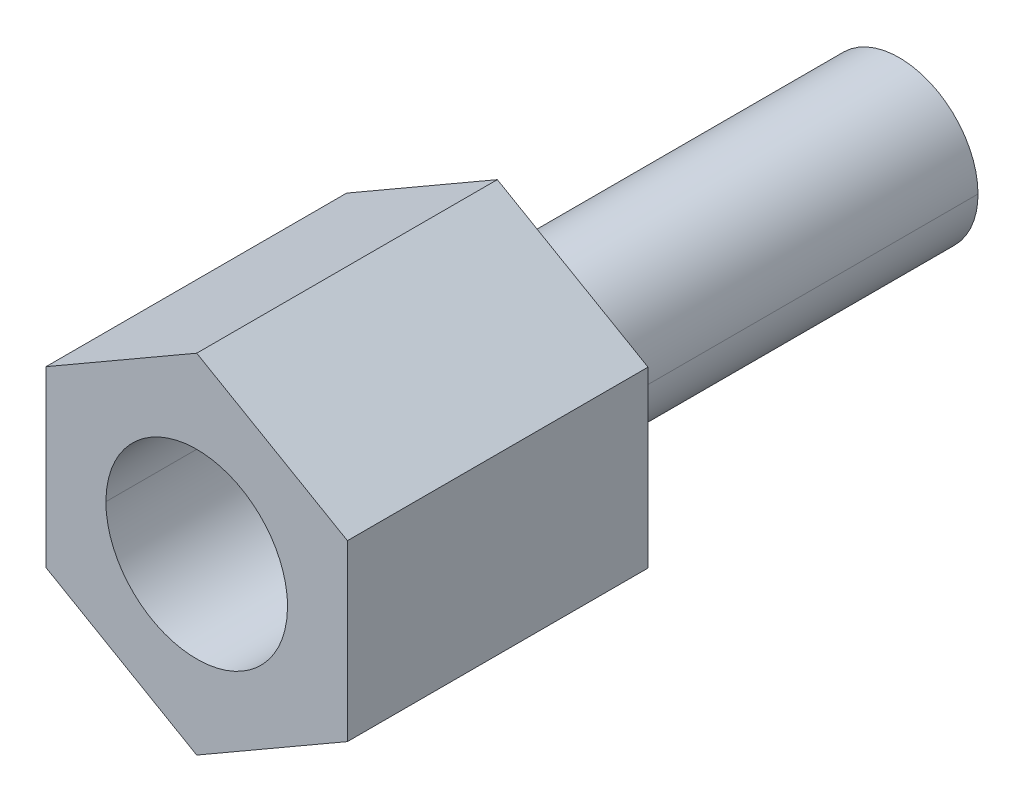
ISO-10303-21;
HEADER;
FILE_DESCRIPTION(('STEP AP214'),'2;1');
FILE_NAME('part.step','',(''),(''),'','','');
FILE_SCHEMA(('AUTOMOTIVE_DESIGN { 1 0 10303 214 1 1 1 1 }'));
ENDSEC;
DATA;
#1=APPLICATION_CONTEXT('core data for automotive mechanical design processes');
#2=APPLICATION_PROTOCOL_DEFINITION('international standard','automotive_design',2000,#1);
#3=PRODUCT_CONTEXT('',#1,'mechanical');
#4=PRODUCT('Part','Part','',(#3));
#5=PRODUCT_RELATED_PRODUCT_CATEGORY('part','',(#4));
#6=PRODUCT_DEFINITION_FORMATION('','',#4);
#7=PRODUCT_DEFINITION_CONTEXT('part definition',#1,'design');
#8=PRODUCT_DEFINITION('design','',#6,#7);
#9=PRODUCT_DEFINITION_SHAPE('','',#8);
#10=(LENGTH_UNIT() NAMED_UNIT(*) SI_UNIT(.MILLI.,.METRE.));
#11=(NAMED_UNIT(*) PLANE_ANGLE_UNIT() SI_UNIT($,.RADIAN.));
#12=(NAMED_UNIT(*) SI_UNIT($,.STERADIAN.) SOLID_ANGLE_UNIT());
#13=UNCERTAINTY_MEASURE_WITH_UNIT(LENGTH_MEASURE(1.E-05),#10,'distance_accuracy_value','');
#14=(GEOMETRIC_REPRESENTATION_CONTEXT(3) GLOBAL_UNCERTAINTY_ASSIGNED_CONTEXT((#13)) GLOBAL_UNIT_ASSIGNED_CONTEXT((#10,
#11,#12)) REPRESENTATION_CONTEXT('',''));
#15=CARTESIAN_POINT('',(0.,0.,0.));
#16=DIRECTION('',(0.,0.,1.));
#17=DIRECTION('',(1.,0.,0.));
#18=AXIS2_PLACEMENT_3D('',#15,#16,#17);
#19=CARTESIAN_POINT('',(0.,0.,4.7498));
#20=DIRECTION('',(0.,0.,-1.));
#21=DIRECTION('',(1.,0.,0.));
#22=AXIS2_PLACEMENT_3D('',#19,#20,#21);
#23=CYLINDRICAL_SURFACE('',#22,1.4351);
#24=CARTESIAN_POINT('',(-1.4351,0.,0.9398));
#25=CARTESIAN_POINT('',(-1.43499449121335,-0.259691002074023,0.9398));
#26=CARTESIAN_POINT('',(-1.36295555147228,-0.519024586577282,0.9398));
#27=CARTESIAN_POINT('',(-1.10452987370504,-0.947232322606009,0.9398));
#28=CARTESIAN_POINT('',(-0.927646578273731,-1.12101765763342,0.9398));
#29=CARTESIAN_POINT('',(-0.519932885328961,-1.35741744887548,0.9398));
#30=CARTESIAN_POINT('',(-0.291923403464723,-1.42395064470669,0.9398));
#31=CARTESIAN_POINT('',(0.215453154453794,-1.44564675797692,0.9398));
#32=CARTESIAN_POINT('',(0.495229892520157,-1.37518110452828,0.9398));
#33=CARTESIAN_POINT('',(0.939985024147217,-1.11068898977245,0.9398));
#34=CARTESIAN_POINT('',(1.1149499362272,-0.934967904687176,0.9398));
#35=CARTESIAN_POINT('',(1.36591891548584,-0.5084744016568,0.9398));
#36=CARTESIAN_POINT('',(1.43499664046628,-0.254401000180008,0.9398));
#37=CARTESIAN_POINT('',(1.4351,0.,0.9398));
#38=B_SPLINE_CURVE_WITH_KNOTS('',3,(#24,#25,#26,#27,#28,#29,#30,#31,#32,#33,#34,#35,#36,#37),
.UNSPECIFIED.,.F.,.F.,(4,2,2,2,2,2,4),(0.,0.1728,0.3328,0.4864,0.67072,0.83072,1.),.UNSPECIFIED.);
#39=CARTESIAN_POINT('',(-1.4351,0.,0.9398));
#40=VERTEX_POINT('',#39);
#41=CARTESIAN_POINT('',(1.4351,0.,0.9398));
#42=VERTEX_POINT('',#41);
#43=EDGE_CURVE('E29',#40,#42,#38,.T.);
#44=ORIENTED_EDGE('',*,*,#43,.F.);
#45=CARTESIAN_POINT('',(-1.4351,0.,4.7498));
#46=CARTESIAN_POINT('',(-1.4351,0.,4.71805));
#47=CARTESIAN_POINT('',(-1.4351,0.,4.6863));
#48=CARTESIAN_POINT('',(-1.4351,0.,4.6228));
#49=CARTESIAN_POINT('',(-1.4351,0.,4.59105));
#50=CARTESIAN_POINT('',(-1.4351,0.,4.52755));
#51=CARTESIAN_POINT('',(-1.4351,0.,4.4958));
#52=CARTESIAN_POINT('',(-1.4351,0.,4.4323));
#53=CARTESIAN_POINT('',(-1.4351,0.,4.40055));
#54=CARTESIAN_POINT('',(-1.4351,0.,4.33705));
#55=CARTESIAN_POINT('',(-1.4351,0.,4.3053));
#56=CARTESIAN_POINT('',(-1.4351,0.,4.2418));
#57=CARTESIAN_POINT('',(-1.4351,0.,4.21005));
#58=CARTESIAN_POINT('',(-1.4351,0.,4.14655));
#59=CARTESIAN_POINT('',(-1.4351,0.,4.1148));
#60=CARTESIAN_POINT('',(-1.4351,0.,4.0513));
#61=CARTESIAN_POINT('',(-1.4351,0.,4.01955));
#62=CARTESIAN_POINT('',(-1.4351,0.,3.95605));
#63=CARTESIAN_POINT('',(-1.4351,0.,3.9243));
#64=CARTESIAN_POINT('',(-1.4351,0.,3.8608));
#65=CARTESIAN_POINT('',(-1.4351,0.,3.82905));
#66=CARTESIAN_POINT('',(-1.4351,0.,3.76555));
#67=CARTESIAN_POINT('',(-1.4351,0.,3.7338));
#68=CARTESIAN_POINT('',(-1.4351,0.,3.6703));
#69=CARTESIAN_POINT('',(-1.4351,0.,3.63855));
#70=CARTESIAN_POINT('',(-1.4351,0.,3.57505));
#71=CARTESIAN_POINT('',(-1.4351,0.,3.5433));
#72=CARTESIAN_POINT('',(-1.4351,0.,3.4798));
#73=CARTESIAN_POINT('',(-1.4351,0.,3.44805));
#74=CARTESIAN_POINT('',(-1.4351,0.,3.38455));
#75=CARTESIAN_POINT('',(-1.4351,0.,3.3528));
#76=CARTESIAN_POINT('',(-1.4351,0.,3.2893));
#77=CARTESIAN_POINT('',(-1.4351,0.,3.25755));
#78=CARTESIAN_POINT('',(-1.4351,0.,3.19405));
#79=CARTESIAN_POINT('',(-1.4351,0.,3.1623));
#80=CARTESIAN_POINT('',(-1.4351,0.,3.0988));
#81=CARTESIAN_POINT('',(-1.4351,0.,3.06705));
#82=CARTESIAN_POINT('',(-1.4351,0.,3.00355));
#83=CARTESIAN_POINT('',(-1.4351,0.,2.9718));
#84=CARTESIAN_POINT('',(-1.4351,0.,2.9083));
#85=CARTESIAN_POINT('',(-1.4351,0.,2.87655));
#86=CARTESIAN_POINT('',(-1.4351,0.,2.81305));
#87=CARTESIAN_POINT('',(-1.4351,0.,2.7813));
#88=CARTESIAN_POINT('',(-1.4351,0.,2.7178));
#89=CARTESIAN_POINT('',(-1.4351,0.,2.68605));
#90=CARTESIAN_POINT('',(-1.4351,0.,2.62255));
#91=CARTESIAN_POINT('',(-1.4351,0.,2.5908));
#92=CARTESIAN_POINT('',(-1.4351,0.,2.5273));
#93=CARTESIAN_POINT('',(-1.4351,0.,2.49555));
#94=CARTESIAN_POINT('',(-1.4351,0.,2.43205));
#95=CARTESIAN_POINT('',(-1.4351,0.,2.4003));
#96=CARTESIAN_POINT('',(-1.4351,0.,2.3368));
#97=CARTESIAN_POINT('',(-1.4351,0.,2.30505));
#98=CARTESIAN_POINT('',(-1.4351,0.,2.24155));
#99=CARTESIAN_POINT('',(-1.4351,0.,2.2098));
#100=CARTESIAN_POINT('',(-1.4351,0.,2.1463));
#101=CARTESIAN_POINT('',(-1.4351,0.,2.11455));
#102=CARTESIAN_POINT('',(-1.4351,0.,2.05105));
#103=CARTESIAN_POINT('',(-1.4351,0.,2.0193));
#104=CARTESIAN_POINT('',(-1.4351,0.,1.9558));
#105=CARTESIAN_POINT('',(-1.4351,0.,1.92405));
#106=CARTESIAN_POINT('',(-1.4351,0.,1.86055));
#107=CARTESIAN_POINT('',(-1.4351,0.,1.8288));
#108=CARTESIAN_POINT('',(-1.4351,0.,1.7653));
#109=CARTESIAN_POINT('',(-1.4351,0.,1.73355));
#110=CARTESIAN_POINT('',(-1.4351,0.,1.67005));
#111=CARTESIAN_POINT('',(-1.4351,0.,1.6383));
#112=CARTESIAN_POINT('',(-1.4351,0.,1.5748));
#113=CARTESIAN_POINT('',(-1.4351,0.,1.54305));
#114=CARTESIAN_POINT('',(-1.4351,0.,1.47955));
#115=CARTESIAN_POINT('',(-1.4351,0.,1.4478));
#116=CARTESIAN_POINT('',(-1.4351,0.,1.3843));
#117=CARTESIAN_POINT('',(-1.4351,0.,1.35255));
#118=CARTESIAN_POINT('',(-1.4351,0.,1.28905));
#119=CARTESIAN_POINT('',(-1.4351,0.,1.2573));
#120=CARTESIAN_POINT('',(-1.4351,0.,1.1938));
#121=CARTESIAN_POINT('',(-1.4351,0.,1.16205));
#122=CARTESIAN_POINT('',(-1.4351,0.,1.09855));
#123=CARTESIAN_POINT('',(-1.4351,0.,1.0668));
#124=CARTESIAN_POINT('',(-1.4351,0.,1.0033));
#125=CARTESIAN_POINT('',(-1.4351,0.,0.971549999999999));
#126=CARTESIAN_POINT('',(-1.4351,0.,0.939799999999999));
#127=B_SPLINE_CURVE_WITH_KNOTS('',3,(#45,#46,#47,#48,#49,#50,#51,#52,#53,#54,#55,#56,#57,#58,
#59,#60,#61,#62,#63,#64,#65,#66,#67,#68,#69,#70,#71,#72,#73,#74,#75,#76,#77,#78,#79,#80,#81,#82,
#83,#84,#85,#86,#87,#88,#89,#90,#91,#92,#93,#94,#95,#96,#97,#98,#99,#100,#101,#102,#103,#104,
#105,#106,#107,#108,#109,#110,#111,#112,#113,#114,#115,#116,#117,#118,#119,#120,#121,#122,#123,
#124,#125,#126),.UNSPECIFIED.,.F.,.F.,(4,2,2,2,2,2,2,2,2,2,2,2,2,2,2,2,2,2,2,2,2,2,2,2,2,2,2,2,
2,2,2,2,2,2,2,2,2,2,2,2,4),(0.,0.0952499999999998,0.1905,0.28575,0.380999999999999,0.47625,
0.5715,0.66675,0.762,0.85725,0.9525,1.04775,1.143,1.23825,1.3335,1.42875,1.524,1.61925,1.7145,
1.80975,1.905,2.00025,2.0955,2.19075,2.286,2.38125,2.4765,2.57175,2.667,2.76225,2.8575,2.95275,
3.048,3.14325,3.2385,3.33375,3.429,3.52425,3.6195,3.71475,3.81),.UNSPECIFIED.);
#128=CARTESIAN_POINT('',(-1.4351,0.,4.7498));
#129=VERTEX_POINT('',#128);
#130=EDGE_CURVE('E34',#129,#40,#127,.T.);
#131=ORIENTED_EDGE('',*,*,#130,.F.);
#132=CARTESIAN_POINT('',(1.4351,0.,4.7498));
#133=CARTESIAN_POINT('',(1.43499449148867,-0.25969032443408,4.7498));
#134=CARTESIAN_POINT('',(1.36295563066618,-0.519024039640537,4.7498));
#135=CARTESIAN_POINT('',(1.10453098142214,-0.947230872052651,4.7498));
#136=CARTESIAN_POINT('',(0.927646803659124,-1.12101733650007,4.7498));
#137=CARTESIAN_POINT('',(0.519934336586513,-1.35741679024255,4.7498));
#138=CARTESIAN_POINT('',(0.291922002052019,-1.42392983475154,4.7498));
#139=CARTESIAN_POINT('',(-0.215452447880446,-1.44564421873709,4.7498));
#140=CARTESIAN_POINT('',(-0.495233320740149,-1.37518350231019,4.7498));
#141=CARTESIAN_POINT('',(-0.939984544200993,-1.11068745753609,4.7498));
#142=CARTESIAN_POINT('',(-1.11494353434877,-0.934962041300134,4.7498));
#143=CARTESIAN_POINT('',(-1.36592670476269,-0.508478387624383,4.7498));
#144=CARTESIAN_POINT('',(-1.43499664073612,-0.254400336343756,4.7498));
#145=CARTESIAN_POINT('',(-1.4351,0.,4.7498));
#146=B_SPLINE_CURVE_WITH_KNOTS('',3,(#132,#133,#134,#135,#136,#137,#138,#139,#140,#141,#142,
#143,#144,#145),.UNSPECIFIED.,.F.,.F.,(4,2,2,2,2,2,4),(0.,0.1728,0.3328,0.4864,0.67072,0.83072,
1.),.UNSPECIFIED.);
#147=CARTESIAN_POINT('',(1.4351,0.,4.7498));
#148=VERTEX_POINT('',#147);
#149=EDGE_CURVE('E253',#148,#129,#146,.T.);
#150=ORIENTED_EDGE('',*,*,#149,.F.);
#151=CARTESIAN_POINT('',(1.4351,0.,4.7498));
#152=CARTESIAN_POINT('',(1.4351,0.,4.71805));
#153=CARTESIAN_POINT('',(1.4351,0.,4.6863));
#154=CARTESIAN_POINT('',(1.4351,0.,4.6228));
#155=CARTESIAN_POINT('',(1.4351,0.,4.59105));
#156=CARTESIAN_POINT('',(1.4351,0.,4.52755));
#157=CARTESIAN_POINT('',(1.4351,0.,4.4958));
#158=CARTESIAN_POINT('',(1.4351,0.,4.4323));
#159=CARTESIAN_POINT('',(1.4351,0.,4.40055));
#160=CARTESIAN_POINT('',(1.4351,0.,4.33705));
#161=CARTESIAN_POINT('',(1.4351,0.,4.3053));
#162=CARTESIAN_POINT('',(1.4351,0.,4.2418));
#163=CARTESIAN_POINT('',(1.4351,0.,4.21005));
#164=CARTESIAN_POINT('',(1.4351,0.,4.14655));
#165=CARTESIAN_POINT('',(1.4351,0.,4.1148));
#166=CARTESIAN_POINT('',(1.4351,0.,4.0513));
#167=CARTESIAN_POINT('',(1.4351,0.,4.01955));
#168=CARTESIAN_POINT('',(1.4351,0.,3.95605));
#169=CARTESIAN_POINT('',(1.4351,0.,3.9243));
#170=CARTESIAN_POINT('',(1.4351,0.,3.8608));
#171=CARTESIAN_POINT('',(1.4351,0.,3.82905));
#172=CARTESIAN_POINT('',(1.4351,0.,3.76555));
#173=CARTESIAN_POINT('',(1.4351,0.,3.7338));
#174=CARTESIAN_POINT('',(1.4351,0.,3.6703));
#175=CARTESIAN_POINT('',(1.4351,0.,3.63855));
#176=CARTESIAN_POINT('',(1.4351,0.,3.57505));
#177=CARTESIAN_POINT('',(1.4351,0.,3.5433));
#178=CARTESIAN_POINT('',(1.4351,0.,3.4798));
#179=CARTESIAN_POINT('',(1.4351,0.,3.44805));
#180=CARTESIAN_POINT('',(1.4351,0.,3.38455));
#181=CARTESIAN_POINT('',(1.4351,0.,3.3528));
#182=CARTESIAN_POINT('',(1.4351,0.,3.2893));
#183=CARTESIAN_POINT('',(1.4351,0.,3.25755));
#184=CARTESIAN_POINT('',(1.4351,0.,3.19405));
#185=CARTESIAN_POINT('',(1.4351,0.,3.1623));
#186=CARTESIAN_POINT('',(1.4351,0.,3.0988));
#187=CARTESIAN_POINT('',(1.4351,0.,3.06705));
#188=CARTESIAN_POINT('',(1.4351,0.,3.00355));
#189=CARTESIAN_POINT('',(1.4351,0.,2.9718));
#190=CARTESIAN_POINT('',(1.4351,0.,2.9083));
#191=CARTESIAN_POINT('',(1.4351,0.,2.87655));
#192=CARTESIAN_POINT('',(1.4351,0.,2.81305));
#193=CARTESIAN_POINT('',(1.4351,0.,2.7813));
#194=CARTESIAN_POINT('',(1.4351,0.,2.7178));
#195=CARTESIAN_POINT('',(1.4351,0.,2.68605));
#196=CARTESIAN_POINT('',(1.4351,0.,2.62255));
#197=CARTESIAN_POINT('',(1.4351,0.,2.5908));
#198=CARTESIAN_POINT('',(1.4351,0.,2.5273));
#199=CARTESIAN_POINT('',(1.4351,0.,2.49555));
#200=CARTESIAN_POINT('',(1.4351,0.,2.43205));
#201=CARTESIAN_POINT('',(1.4351,0.,2.4003));
#202=CARTESIAN_POINT('',(1.4351,0.,2.3368));
#203=CARTESIAN_POINT('',(1.4351,0.,2.30505));
#204=CARTESIAN_POINT('',(1.4351,0.,2.24155));
#205=CARTESIAN_POINT('',(1.4351,0.,2.2098));
#206=CARTESIAN_POINT('',(1.4351,0.,2.1463));
#207=CARTESIAN_POINT('',(1.4351,0.,2.11455));
#208=CARTESIAN_POINT('',(1.4351,0.,2.05105));
#209=CARTESIAN_POINT('',(1.4351,0.,2.0193));
#210=CARTESIAN_POINT('',(1.4351,0.,1.9558));
#211=CARTESIAN_POINT('',(1.4351,0.,1.92405));
#212=CARTESIAN_POINT('',(1.4351,0.,1.86055));
#213=CARTESIAN_POINT('',(1.4351,0.,1.8288));
#214=CARTESIAN_POINT('',(1.4351,0.,1.7653));
#215=CARTESIAN_POINT('',(1.4351,0.,1.73355));
#216=CARTESIAN_POINT('',(1.4351,0.,1.67005));
#217=CARTESIAN_POINT('',(1.4351,0.,1.6383));
#218=CARTESIAN_POINT('',(1.4351,0.,1.5748));
#219=CARTESIAN_POINT('',(1.4351,0.,1.54305));
#220=CARTESIAN_POINT('',(1.4351,0.,1.47955));
#221=CARTESIAN_POINT('',(1.4351,0.,1.4478));
#222=CARTESIAN_POINT('',(1.4351,0.,1.3843));
#223=CARTESIAN_POINT('',(1.4351,0.,1.35255));
#224=CARTESIAN_POINT('',(1.4351,0.,1.28905));
#225=CARTESIAN_POINT('',(1.4351,0.,1.2573));
#226=CARTESIAN_POINT('',(1.4351,0.,1.1938));
#227=CARTESIAN_POINT('',(1.4351,0.,1.16205));
#228=CARTESIAN_POINT('',(1.4351,0.,1.09855));
#229=CARTESIAN_POINT('',(1.4351,0.,1.0668));
#230=CARTESIAN_POINT('',(1.4351,0.,1.0033));
#231=CARTESIAN_POINT('',(1.4351,0.,0.971549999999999));
#232=CARTESIAN_POINT('',(1.4351,0.,0.939799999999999));
#233=B_SPLINE_CURVE_WITH_KNOTS('',3,(#151,#152,#153,#154,#155,#156,#157,#158,#159,#160,#161,
#162,#163,#164,#165,#166,#167,#168,#169,#170,#171,#172,#173,#174,#175,#176,#177,#178,#179,#180,
#181,#182,#183,#184,#185,#186,#187,#188,#189,#190,#191,#192,#193,#194,#195,#196,#197,#198,#199,
#200,#201,#202,#203,#204,#205,#206,#207,#208,#209,#210,#211,#212,#213,#214,#215,#216,#217,#218,
#219,#220,#221,#222,#223,#224,#225,#226,#227,#228,#229,#230,#231,#232),.UNSPECIFIED.,.F.,.F.,(4,
2,2,2,2,2,2,2,2,2,2,2,2,2,2,2,2,2,2,2,2,2,2,2,2,2,2,2,2,2,2,2,2,2,2,2,2,2,2,2,4),(0.,
0.0952499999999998,0.1905,0.28575,0.380999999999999,0.47625,0.5715,0.66675,0.762,0.85725,0.9525,
1.04775,1.143,1.23825,1.3335,1.42875,1.524,1.61925,1.7145,1.80975,1.905,2.00025,2.0955,2.19075,
2.286,2.38125,2.4765,2.57175,2.667,2.76225,2.8575,2.95275,3.048,3.14325,3.2385,3.33375,3.429,
3.52425,3.6195,3.71475,3.81),.UNSPECIFIED.);
#234=EDGE_CURVE('E10',#148,#42,#233,.T.);
#235=ORIENTED_EDGE('',*,*,#234,.T.);
#236=EDGE_LOOP('',(#44,#131,#150,#235));
#237=FACE_BOUND('',#236,.T.);
#238=ADVANCED_FACE('F15',(#237),#23,.F.);
#239=CARTESIAN_POINT('',(-1.4351,-1.47560979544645,0.9398));
#240=DIRECTION('',(0.,0.,1.));
#241=DIRECTION('',(1.,0.,0.));
#242=AXIS2_PLACEMENT_3D('',#239,#240,#241);
#243=PLANE('',#242);
#244=CARTESIAN_POINT('',(1.4351,0.,0.9398));
#245=CARTESIAN_POINT('',(1.43499449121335,0.259691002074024,0.9398));
#246=CARTESIAN_POINT('',(1.36295555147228,0.519024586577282,0.9398));
#247=CARTESIAN_POINT('',(1.10452987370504,0.947232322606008,0.9398));
#248=CARTESIAN_POINT('',(0.927646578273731,1.12101765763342,0.9398));
#249=CARTESIAN_POINT('',(0.519932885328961,1.35741744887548,0.9398));
#250=CARTESIAN_POINT('',(0.291923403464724,1.42395064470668,0.9398));
#251=CARTESIAN_POINT('',(-0.215453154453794,1.44564675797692,0.9398));
#252=CARTESIAN_POINT('',(-0.495229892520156,1.37518110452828,0.9398));
#253=CARTESIAN_POINT('',(-0.939985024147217,1.11068898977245,0.9398));
#254=CARTESIAN_POINT('',(-1.11494993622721,0.934967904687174,0.9398));
#255=CARTESIAN_POINT('',(-1.36591891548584,0.508474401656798,0.9398));
#256=CARTESIAN_POINT('',(-1.43499664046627,0.254401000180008,0.9398));
#257=CARTESIAN_POINT('',(-1.4351,0.,0.9398));
#258=B_SPLINE_CURVE_WITH_KNOTS('',3,(#244,#245,#246,#247,#248,#249,#250,#251,#252,#253,#254,
#255,#256,#257),.UNSPECIFIED.,.F.,.F.,(4,2,2,2,2,2,4),(0.,0.1728,0.3328,0.4864,0.67072,0.83072,
1.),.UNSPECIFIED.);
#259=EDGE_CURVE('E24',#42,#40,#258,.T.);
#260=ORIENTED_EDGE('',*,*,#259,.T.);
#261=ORIENTED_EDGE('',*,*,#43,.T.);
#262=EDGE_LOOP('',(#260,#261));
#263=FACE_BOUND('',#262,.T.);
#264=ADVANCED_FACE('F264',(#263),#243,.T.);
#265=CARTESIAN_POINT('',(0.,0.,4.7498));
#266=DIRECTION('',(0.,0.,-1.));
#267=DIRECTION('',(-1.,0.,0.));
#268=AXIS2_PLACEMENT_3D('',#265,#266,#267);
#269=CYLINDRICAL_SURFACE('',#268,1.4351);
#270=CARTESIAN_POINT('',(-1.4351,0.,4.7498));
#271=CARTESIAN_POINT('',(-1.43499449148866,0.259690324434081,4.7498));
#272=CARTESIAN_POINT('',(-1.36295563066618,0.519024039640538,4.7498));
#273=CARTESIAN_POINT('',(-1.10453098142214,0.947230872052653,4.7498));
#274=CARTESIAN_POINT('',(-0.927646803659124,1.12101733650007,4.7498));
#275=CARTESIAN_POINT('',(-0.519934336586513,1.35741679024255,4.7498));
#276=CARTESIAN_POINT('',(-0.29192200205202,1.42392983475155,4.7498));
#277=CARTESIAN_POINT('',(0.215452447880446,1.44564421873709,4.7498));
#278=CARTESIAN_POINT('',(0.495233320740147,1.37518350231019,4.7498));
#279=CARTESIAN_POINT('',(0.939984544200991,1.11068745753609,4.7498));
#280=CARTESIAN_POINT('',(1.11494353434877,0.934962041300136,4.7498));
#281=CARTESIAN_POINT('',(1.36592670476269,0.508478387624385,4.7498));
#282=CARTESIAN_POINT('',(1.43499664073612,0.254400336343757,4.7498));
#283=CARTESIAN_POINT('',(1.4351,0.,4.7498));
#284=B_SPLINE_CURVE_WITH_KNOTS('',3,(#270,#271,#272,#273,#274,#275,#276,#277,#278,#279,#280,
#281,#282,#283),.UNSPECIFIED.,.F.,.F.,(4,2,2,2,2,2,4),(0.,0.1728,0.3328,0.4864,
0.670720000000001,0.830720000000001,1.),.UNSPECIFIED.);
#285=EDGE_CURVE('E250',#129,#148,#284,.T.);
#286=ORIENTED_EDGE('',*,*,#285,.F.);
#287=ORIENTED_EDGE('',*,*,#130,.T.);
#288=ORIENTED_EDGE('',*,*,#259,.F.);
#289=ORIENTED_EDGE('',*,*,#234,.F.);
#290=EDGE_LOOP('',(#286,#287,#288,#289));
#291=FACE_BOUND('',#290,.T.);
#292=ADVANCED_FACE('F304',(#291),#269,.F.);
#293=CARTESIAN_POINT('',(-2.38125,-2.74963065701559,4.7498));
#294=DIRECTION('',(0.,0.,1.));
#295=DIRECTION('',(1.,0.,0.));
#296=AXIS2_PLACEMENT_3D('',#293,#294,#295);
#297=PLANE('',#296);
#298=CARTESIAN_POINT('',(2.38125,1.3748153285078,4.7498));
#299=CARTESIAN_POINT('',(2.38125,1.19150661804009,4.7498));
#300=CARTESIAN_POINT('',(2.38125,1.00819790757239,4.7498));
#301=CARTESIAN_POINT('',(2.38125,0.641580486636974,4.7498));
#302=CARTESIAN_POINT('',(2.38125,0.458271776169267,4.7498));
#303=CARTESIAN_POINT('',(2.38125,0.0916543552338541,4.7498));
#304=CARTESIAN_POINT('',(2.38125,-0.0916543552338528,4.7498));
#305=CARTESIAN_POINT('',(2.38125,-0.458271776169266,4.7498));
#306=CARTESIAN_POINT('',(2.38125,-0.641580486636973,4.7498));
#307=CARTESIAN_POINT('',(2.38125,-1.00819790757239,4.7498));
#308=CARTESIAN_POINT('',(2.38125,-1.19150661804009,4.7498));
#309=CARTESIAN_POINT('',(2.38125,-1.3748153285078,4.7498));
#310=B_SPLINE_CURVE_WITH_KNOTS('',3,(#298,#299,#300,#301,#302,#303,#304,#305,#306,#307,#308,
#309),.UNSPECIFIED.,.F.,.F.,(4,2,2,2,2,4),(0.,0.2,0.4,0.6,0.8,1.),.UNSPECIFIED.);
#311=CARTESIAN_POINT('',(2.38125,1.3748153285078,4.7498));
#312=VERTEX_POINT('',#311);
#313=CARTESIAN_POINT('',(2.38125,-1.3748153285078,4.7498));
#314=VERTEX_POINT('',#313);
#315=EDGE_CURVE('E248',#312,#314,#310,.T.);
#316=ORIENTED_EDGE('',*,*,#315,.F.);
#317=CARTESIAN_POINT('',(0.,2.74963065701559,4.7498));
#318=CARTESIAN_POINT('',(0.15875,2.65797630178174,4.7498));
#319=CARTESIAN_POINT('',(0.3175,2.56632194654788,4.7498));
#320=CARTESIAN_POINT('',(0.634999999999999,2.38301323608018,4.7498));
#321=CARTESIAN_POINT('',(0.793749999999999,2.29135888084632,4.7498));
#322=CARTESIAN_POINT('',(1.11125,2.10805017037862,4.7498));
#323=CARTESIAN_POINT('',(1.27,2.01639581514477,4.7498));
#324=CARTESIAN_POINT('',(1.5875,1.83308710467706,4.7498));
#325=CARTESIAN_POINT('',(1.74625,1.74143274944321,4.7498));
#326=CARTESIAN_POINT('',(2.06375,1.5581240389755,4.7498));
#327=CARTESIAN_POINT('',(2.2225,1.46646968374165,4.7498));
#328=CARTESIAN_POINT('',(2.38125,1.3748153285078,4.7498));
#329=B_SPLINE_CURVE_WITH_KNOTS('',3,(#317,#318,#319,#320,#321,#322,#323,#324,#325,#326,#327,
#328),.UNSPECIFIED.,.F.,.F.,(4,2,2,2,2,4),(0.,0.2,0.4,0.6,0.8,1.),.UNSPECIFIED.);
#330=CARTESIAN_POINT('',(0.,2.74963065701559,4.7498));
#331=VERTEX_POINT('',#330);
#332=EDGE_CURVE('E237',#331,#312,#329,.T.);
#333=ORIENTED_EDGE('',*,*,#332,.F.);
#334=CARTESIAN_POINT('',(-2.38125,1.3748153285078,4.7498));
#335=CARTESIAN_POINT('',(-2.2225,1.46646968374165,4.7498));
#336=CARTESIAN_POINT('',(-2.06375,1.55812403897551,4.7498));
#337=CARTESIAN_POINT('',(-1.74625,1.74143274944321,4.7498));
#338=CARTESIAN_POINT('',(-1.5875,1.83308710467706,4.7498));
#339=CARTESIAN_POINT('',(-1.27,2.01639581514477,4.7498));
#340=CARTESIAN_POINT('',(-1.11125,2.10805017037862,4.7498));
#341=CARTESIAN_POINT('',(-0.79375,2.29135888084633,4.7498));
#342=CARTESIAN_POINT('',(-0.635000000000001,2.38301323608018,4.7498));
#343=CARTESIAN_POINT('',(-0.317500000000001,2.56632194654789,4.7498));
#344=CARTESIAN_POINT('',(-0.158750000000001,2.65797630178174,4.7498));
#345=CARTESIAN_POINT('',(0.,2.74963065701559,4.7498));
#346=B_SPLINE_CURVE_WITH_KNOTS('',3,(#334,#335,#336,#337,#338,#339,#340,#341,#342,#343,#344,
#345),.UNSPECIFIED.,.F.,.F.,(4,2,2,2,2,4),(0.,0.2,0.4,0.6,0.8,1.),.UNSPECIFIED.);
#347=CARTESIAN_POINT('',(-2.38125,1.3748153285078,4.7498));
#348=VERTEX_POINT('',#347);
#349=EDGE_CURVE('E226',#348,#331,#346,.T.);
#350=ORIENTED_EDGE('',*,*,#349,.F.);
#351=CARTESIAN_POINT('',(-2.38125,-1.37481532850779,4.7498));
#352=CARTESIAN_POINT('',(-2.38125,-1.19150661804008,4.7498));
#353=CARTESIAN_POINT('',(-2.38125,-1.00819790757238,4.7498));
#354=CARTESIAN_POINT('',(-2.38125,-0.641580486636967,4.7498));
#355=CARTESIAN_POINT('',(-2.38125,-0.45827177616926,4.7498));
#356=CARTESIAN_POINT('',(-2.38125,-0.0916543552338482,4.7498));
#357=CARTESIAN_POINT('',(-2.38125,0.091654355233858,4.7498));
#358=CARTESIAN_POINT('',(-2.38125,0.45827177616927,4.7498));
#359=CARTESIAN_POINT('',(-2.38125,0.641580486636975,4.7498));
#360=CARTESIAN_POINT('',(-2.38125,1.00819790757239,4.7498));
#361=CARTESIAN_POINT('',(-2.38125,1.19150661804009,4.7498));
#362=CARTESIAN_POINT('',(-2.38125,1.3748153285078,4.7498));
#363=B_SPLINE_CURVE_WITH_KNOTS('',3,(#351,#352,#353,#354,#355,#356,#357,#358,#359,#360,#361,
#362),.UNSPECIFIED.,.F.,.F.,(4,2,2,2,2,4),(0.,0.2,0.4,0.6,0.8,1.),.UNSPECIFIED.);
#364=CARTESIAN_POINT('',(-2.38125,-1.37481532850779,4.7498));
#365=VERTEX_POINT('',#364);
#366=EDGE_CURVE('E215',#365,#348,#363,.T.);
#367=ORIENTED_EDGE('',*,*,#366,.F.);
#368=CARTESIAN_POINT('',(0.,-2.74963065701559,4.7498));
#369=CARTESIAN_POINT('',(-0.158750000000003,-2.65797630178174,4.7498));
#370=CARTESIAN_POINT('',(-0.317500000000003,-2.56632194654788,4.7498));
#371=CARTESIAN_POINT('',(-0.635000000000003,-2.38301323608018,4.7498));
#372=CARTESIAN_POINT('',(-0.793750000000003,-2.29135888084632,4.7498));
#373=CARTESIAN_POINT('',(-1.11125,-2.10805017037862,4.7498));
#374=CARTESIAN_POINT('',(-1.27,-2.01639581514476,4.7498));
#375=CARTESIAN_POINT('',(-1.5875,-1.83308710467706,4.7498));
#376=CARTESIAN_POINT('',(-1.74625,-1.7414327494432,4.7498));
#377=CARTESIAN_POINT('',(-2.06375,-1.5581240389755,4.7498));
#378=CARTESIAN_POINT('',(-2.2225,-1.46646968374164,4.7498));
#379=CARTESIAN_POINT('',(-2.38125,-1.37481532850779,4.7498));
#380=B_SPLINE_CURVE_WITH_KNOTS('',3,(#368,#369,#370,#371,#372,#373,#374,#375,#376,#377,#378,
#379),.UNSPECIFIED.,.F.,.F.,(4,2,2,2,2,4),(0.,0.2,0.4,0.6,0.8,1.),.UNSPECIFIED.);
#381=CARTESIAN_POINT('',(0.,-2.74963065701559,4.7498));
#382=VERTEX_POINT('',#381);
#383=EDGE_CURVE('E204',#382,#365,#380,.T.);
#384=ORIENTED_EDGE('',*,*,#383,.F.);
#385=CARTESIAN_POINT('',(2.38125,-1.3748153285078,4.7498));
#386=CARTESIAN_POINT('',(2.2225,-1.46646968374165,4.7498));
#387=CARTESIAN_POINT('',(2.06375,-1.55812403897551,4.7498));
#388=CARTESIAN_POINT('',(1.74625,-1.74143274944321,4.7498));
#389=CARTESIAN_POINT('',(1.5875,-1.83308710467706,4.7498));
#390=CARTESIAN_POINT('',(1.27,-2.01639581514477,4.7498));
#391=CARTESIAN_POINT('',(1.11125,-2.10805017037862,4.7498));
#392=CARTESIAN_POINT('',(0.793749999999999,-2.29135888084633,4.7498));
#393=CARTESIAN_POINT('',(0.634999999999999,-2.38301323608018,4.7498));
#394=CARTESIAN_POINT('',(0.317499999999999,-2.56632194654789,4.7498));
#395=CARTESIAN_POINT('',(0.15875,-2.65797630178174,4.7498));
#396=CARTESIAN_POINT('',(0.,-2.74963065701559,4.7498));
#397=B_SPLINE_CURVE_WITH_KNOTS('',3,(#385,#386,#387,#388,#389,#390,#391,#392,#393,#394,#395,
#396),.UNSPECIFIED.,.F.,.F.,(4,2,2,2,2,4),(0.,0.2,0.4,0.6,0.8,1.),.UNSPECIFIED.);
#398=EDGE_CURVE('E192',#314,#382,#397,.T.);
#399=ORIENTED_EDGE('',*,*,#398,.F.);
#400=EDGE_LOOP('',(#316,#333,#350,#367,#384,#399));
#401=FACE_BOUND('',#400,.T.);
#402=ORIENTED_EDGE('',*,*,#149,.T.);
#403=ORIENTED_EDGE('',*,*,#285,.T.);
#404=EDGE_LOOP('',(#402,#403));
#405=FACE_BOUND('',#404,.T.);
#406=ADVANCED_FACE('F323',(#401,#405),#297,.T.);
#407=CARTESIAN_POINT('',(2.38125,-1.3748153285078,0.));
#408=DIRECTION('',(1.,0.,0.));
#409=DIRECTION('',(0.,1.,0.));
#410=AXIS2_PLACEMENT_3D('',#407,#408,#409);
#411=PLANE('',#410);
#412=ORIENTED_EDGE('',*,*,#315,.T.);
#413=CARTESIAN_POINT('',(2.38125,-1.3748153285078,0.));
#414=CARTESIAN_POINT('',(2.38125,-1.3748153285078,0.316653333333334));
#415=CARTESIAN_POINT('',(2.38125,-1.3748153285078,0.633306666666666));
#416=CARTESIAN_POINT('',(2.38125,-1.3748153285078,1.26661333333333));
#417=CARTESIAN_POINT('',(2.38125,-1.3748153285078,1.58326666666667));
#418=CARTESIAN_POINT('',(2.38125,-1.3748153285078,2.21657333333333));
#419=CARTESIAN_POINT('',(2.38125,-1.3748153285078,2.53322666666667));
#420=CARTESIAN_POINT('',(2.38125,-1.3748153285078,3.16653333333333));
#421=CARTESIAN_POINT('',(2.38125,-1.3748153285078,3.48318666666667));
#422=CARTESIAN_POINT('',(2.38125,-1.3748153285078,4.11649333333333));
#423=CARTESIAN_POINT('',(2.38125,-1.3748153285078,4.43314666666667));
#424=CARTESIAN_POINT('',(2.38125,-1.3748153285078,4.7498));
#425=B_SPLINE_CURVE_WITH_KNOTS('',3,(#413,#414,#415,#416,#417,#418,#419,#420,#421,#422,#423,
#424),.UNSPECIFIED.,.F.,.F.,(4,2,2,2,2,4),(0.,0.2,0.4,0.6,0.8,1.),.UNSPECIFIED.);
#426=CARTESIAN_POINT('',(2.38125,-1.3748153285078,0.));
#427=VERTEX_POINT('',#426);
#428=EDGE_CURVE('E184',#427,#314,#425,.T.);
#429=ORIENTED_EDGE('',*,*,#428,.F.);
#430=CARTESIAN_POINT('',(2.38125,-1.3748153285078,0.));
#431=CARTESIAN_POINT('',(2.38125,-1.19150661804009,0.));
#432=CARTESIAN_POINT('',(2.38125,-1.00819790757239,0.));
#433=CARTESIAN_POINT('',(2.38125,-0.641580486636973,0.));
#434=CARTESIAN_POINT('',(2.38125,-0.458271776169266,0.));
#435=CARTESIAN_POINT('',(2.38125,-0.0916543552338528,0.));
#436=CARTESIAN_POINT('',(2.38125,0.0916543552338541,0.));
#437=CARTESIAN_POINT('',(2.38125,0.458271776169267,0.));
#438=CARTESIAN_POINT('',(2.38125,0.641580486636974,0.));
#439=CARTESIAN_POINT('',(2.38125,1.00819790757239,0.));
#440=CARTESIAN_POINT('',(2.38125,1.19150661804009,0.));
#441=CARTESIAN_POINT('',(2.38125,1.3748153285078,0.));
#442=B_SPLINE_CURVE_WITH_KNOTS('',3,(#430,#431,#432,#433,#434,#435,#436,#437,#438,#439,#440,
#441),.UNSPECIFIED.,.F.,.F.,(4,2,2,2,2,4),(0.,0.2,0.4,0.6,0.8,1.),.UNSPECIFIED.);
#443=CARTESIAN_POINT('',(2.38125,1.3748153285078,0.));
#444=VERTEX_POINT('',#443);
#445=EDGE_CURVE('E244',#427,#444,#442,.T.);
#446=ORIENTED_EDGE('',*,*,#445,.T.);
#447=CARTESIAN_POINT('',(2.38125,1.3748153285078,0.));
#448=CARTESIAN_POINT('',(2.38125,1.3748153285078,0.316653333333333));
#449=CARTESIAN_POINT('',(2.38125,1.3748153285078,0.633306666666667));
#450=CARTESIAN_POINT('',(2.38125,1.3748153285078,1.26661333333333));
#451=CARTESIAN_POINT('',(2.38125,1.3748153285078,1.58326666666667));
#452=CARTESIAN_POINT('',(2.38125,1.3748153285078,2.21657333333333));
#453=CARTESIAN_POINT('',(2.38125,1.3748153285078,2.53322666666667));
#454=CARTESIAN_POINT('',(2.38125,1.3748153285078,3.16653333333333));
#455=CARTESIAN_POINT('',(2.38125,1.3748153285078,3.48318666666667));
#456=CARTESIAN_POINT('',(2.38125,1.3748153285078,4.11649333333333));
#457=CARTESIAN_POINT('',(2.38125,1.3748153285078,4.43314666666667));
#458=CARTESIAN_POINT('',(2.38125,1.3748153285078,4.7498));
#459=B_SPLINE_CURVE_WITH_KNOTS('',3,(#447,#448,#449,#450,#451,#452,#453,#454,#455,#456,#457,
#458),.UNSPECIFIED.,.F.,.F.,(4,2,2,2,2,4),(0.,0.2,0.4,0.6,0.8,1.),.UNSPECIFIED.);
#460=EDGE_CURVE('E241',#444,#312,#459,.T.);
#461=ORIENTED_EDGE('',*,*,#460,.T.);
#462=EDGE_LOOP('',(#412,#429,#446,#461));
#463=FACE_BOUND('',#462,.T.);
#464=ADVANCED_FACE('F364',(#463),#411,.T.);
#465=CARTESIAN_POINT('',(0.,2.74963065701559,4.7498));
#466=DIRECTION('',(0.5,0.866025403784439,0.));
#467=DIRECTION('',(0.866025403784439,-0.5,0.));
#468=AXIS2_PLACEMENT_3D('',#465,#466,#467);
#469=PLANE('',#468);
#470=ORIENTED_EDGE('',*,*,#332,.T.);
#471=ORIENTED_EDGE('',*,*,#460,.F.);
#472=CARTESIAN_POINT('',(2.38125,1.3748153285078,0.));
#473=CARTESIAN_POINT('',(2.2225,1.46646968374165,0.));
#474=CARTESIAN_POINT('',(2.06375,1.5581240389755,0.));
#475=CARTESIAN_POINT('',(1.74625,1.74143274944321,0.));
#476=CARTESIAN_POINT('',(1.5875,1.83308710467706,0.));
#477=CARTESIAN_POINT('',(1.27,2.01639581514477,0.));
#478=CARTESIAN_POINT('',(1.11125,2.10805017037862,0.));
#479=CARTESIAN_POINT('',(0.793749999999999,2.29135888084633,0.));
#480=CARTESIAN_POINT('',(0.634999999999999,2.38301323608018,0.));
#481=CARTESIAN_POINT('',(0.3175,2.56632194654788,0.));
#482=CARTESIAN_POINT('',(0.15875,2.65797630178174,0.));
#483=CARTESIAN_POINT('',(0.,2.74963065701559,0.));
#484=B_SPLINE_CURVE_WITH_KNOTS('',3,(#472,#473,#474,#475,#476,#477,#478,#479,#480,#481,#482,
#483),.UNSPECIFIED.,.F.,.F.,(4,2,2,2,2,4),(0.,0.2,0.4,0.6,0.8,1.),.UNSPECIFIED.);
#485=CARTESIAN_POINT('',(0.,2.74963065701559,0.));
#486=VERTEX_POINT('',#485);
#487=EDGE_CURVE('E233',#444,#486,#484,.T.);
#488=ORIENTED_EDGE('',*,*,#487,.T.);
#489=CARTESIAN_POINT('',(0.,2.74963065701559,0.));
#490=CARTESIAN_POINT('',(0.,2.74963065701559,0.316653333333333));
#491=CARTESIAN_POINT('',(0.,2.74963065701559,0.633306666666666));
#492=CARTESIAN_POINT('',(0.,2.74963065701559,1.26661333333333));
#493=CARTESIAN_POINT('',(0.,2.74963065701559,1.58326666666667));
#494=CARTESIAN_POINT('',(0.,2.74963065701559,2.21657333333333));
#495=CARTESIAN_POINT('',(0.,2.74963065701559,2.53322666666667));
#496=CARTESIAN_POINT('',(0.,2.74963065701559,3.16653333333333));
#497=CARTESIAN_POINT('',(0.,2.74963065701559,3.48318666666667));
#498=CARTESIAN_POINT('',(0.,2.74963065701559,4.11649333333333));
#499=CARTESIAN_POINT('',(0.,2.74963065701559,4.43314666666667));
#500=CARTESIAN_POINT('',(0.,2.74963065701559,4.7498));
#501=B_SPLINE_CURVE_WITH_KNOTS('',3,(#489,#490,#491,#492,#493,#494,#495,#496,#497,#498,#499,
#500),.UNSPECIFIED.,.F.,.F.,(4,2,2,2,2,4),(0.,0.2,0.4,0.6,0.8,1.),.UNSPECIFIED.);
#502=EDGE_CURVE('E230',#486,#331,#501,.T.);
#503=ORIENTED_EDGE('',*,*,#502,.T.);
#504=EDGE_LOOP('',(#470,#471,#488,#503));
#505=FACE_BOUND('',#504,.T.);
#506=ADVANCED_FACE('F368',(#505),#469,.T.);
#507=CARTESIAN_POINT('',(-2.38125,1.3748153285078,4.7498));
#508=DIRECTION('',(-0.5,0.866025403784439,0.));
#509=DIRECTION('',(0.866025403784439,0.5,0.));
#510=AXIS2_PLACEMENT_3D('',#507,#508,#509);
#511=PLANE('',#510);
#512=ORIENTED_EDGE('',*,*,#349,.T.);
#513=ORIENTED_EDGE('',*,*,#502,.F.);
#514=CARTESIAN_POINT('',(0.,2.74963065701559,0.));
#515=CARTESIAN_POINT('',(-0.158750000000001,2.65797630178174,0.));
#516=CARTESIAN_POINT('',(-0.317500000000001,2.56632194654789,0.));
#517=CARTESIAN_POINT('',(-0.635000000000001,2.38301323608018,0.));
#518=CARTESIAN_POINT('',(-0.79375,2.29135888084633,0.));
#519=CARTESIAN_POINT('',(-1.11125,2.10805017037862,0.));
#520=CARTESIAN_POINT('',(-1.27,2.01639581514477,0.));
#521=CARTESIAN_POINT('',(-1.5875,1.83308710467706,0.));
#522=CARTESIAN_POINT('',(-1.74625,1.74143274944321,0.));
#523=CARTESIAN_POINT('',(-2.06375,1.55812403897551,0.));
#524=CARTESIAN_POINT('',(-2.2225,1.46646968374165,0.));
#525=CARTESIAN_POINT('',(-2.38125,1.3748153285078,0.));
#526=B_SPLINE_CURVE_WITH_KNOTS('',3,(#514,#515,#516,#517,#518,#519,#520,#521,#522,#523,#524,
#525),.UNSPECIFIED.,.F.,.F.,(4,2,2,2,2,4),(0.,0.2,0.4,0.6,0.8,1.),.UNSPECIFIED.);
#527=CARTESIAN_POINT('',(-2.38125,1.3748153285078,0.));
#528=VERTEX_POINT('',#527);
#529=EDGE_CURVE('E222',#486,#528,#526,.T.);
#530=ORIENTED_EDGE('',*,*,#529,.T.);
#531=CARTESIAN_POINT('',(-2.38125,1.3748153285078,0.));
#532=CARTESIAN_POINT('',(-2.38125,1.3748153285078,0.316653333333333));
#533=CARTESIAN_POINT('',(-2.38125,1.3748153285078,0.633306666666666));
#534=CARTESIAN_POINT('',(-2.38125,1.3748153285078,1.26661333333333));
#535=CARTESIAN_POINT('',(-2.38125,1.3748153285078,1.58326666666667));
#536=CARTESIAN_POINT('',(-2.38125,1.3748153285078,2.21657333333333));
#537=CARTESIAN_POINT('',(-2.38125,1.3748153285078,2.53322666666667));
#538=CARTESIAN_POINT('',(-2.38125,1.3748153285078,3.16653333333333));
#539=CARTESIAN_POINT('',(-2.38125,1.3748153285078,3.48318666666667));
#540=CARTESIAN_POINT('',(-2.38125,1.3748153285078,4.11649333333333));
#541=CARTESIAN_POINT('',(-2.38125,1.3748153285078,4.43314666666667));
#542=CARTESIAN_POINT('',(-2.38125,1.3748153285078,4.7498));
#543=B_SPLINE_CURVE_WITH_KNOTS('',3,(#531,#532,#533,#534,#535,#536,#537,#538,#539,#540,#541,
#542),.UNSPECIFIED.,.F.,.F.,(4,2,2,2,2,4),(0.,0.2,0.4,0.6,0.8,1.),.UNSPECIFIED.);
#544=EDGE_CURVE('E219',#528,#348,#543,.T.);
#545=ORIENTED_EDGE('',*,*,#544,.T.);
#546=EDGE_LOOP('',(#512,#513,#530,#545));
#547=FACE_BOUND('',#546,.T.);
#548=ADVANCED_FACE('F371',(#547),#511,.T.);
#549=CARTESIAN_POINT('',(-2.38125,1.3748153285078,0.));
#550=DIRECTION('',(-1.,0.,0.));
#551=DIRECTION('',(0.,-1.,0.));
#552=AXIS2_PLACEMENT_3D('',#549,#550,#551);
#553=PLANE('',#552);
#554=ORIENTED_EDGE('',*,*,#366,.T.);
#555=ORIENTED_EDGE('',*,*,#544,.F.);
#556=CARTESIAN_POINT('',(-2.38125,1.3748153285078,0.));
#557=CARTESIAN_POINT('',(-2.38125,1.19150661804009,0.));
#558=CARTESIAN_POINT('',(-2.38125,1.00819790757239,0.));
#559=CARTESIAN_POINT('',(-2.38125,0.641580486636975,0.));
#560=CARTESIAN_POINT('',(-2.38125,0.458271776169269,0.));
#561=CARTESIAN_POINT('',(-2.38125,0.0916543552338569,0.));
#562=CARTESIAN_POINT('',(-2.38125,-0.0916543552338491,0.));
#563=CARTESIAN_POINT('',(-2.38125,-0.458271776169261,0.));
#564=CARTESIAN_POINT('',(-2.38125,-0.641580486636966,0.));
#565=CARTESIAN_POINT('',(-2.38125,-1.00819790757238,0.));
#566=CARTESIAN_POINT('',(-2.38125,-1.19150661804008,0.));
#567=CARTESIAN_POINT('',(-2.38125,-1.37481532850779,0.));
#568=B_SPLINE_CURVE_WITH_KNOTS('',3,(#556,#557,#558,#559,#560,#561,#562,#563,#564,#565,#566,
#567),.UNSPECIFIED.,.F.,.F.,(4,2,2,2,2,4),(0.,0.2,0.4,0.6,0.8,1.),.UNSPECIFIED.);
#569=CARTESIAN_POINT('',(-2.38125,-1.37481532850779,0.));
#570=VERTEX_POINT('',#569);
#571=EDGE_CURVE('E211',#528,#570,#568,.T.);
#572=ORIENTED_EDGE('',*,*,#571,.T.);
#573=CARTESIAN_POINT('',(-2.38125,-1.37481532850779,0.));
#574=CARTESIAN_POINT('',(-2.38125,-1.37481532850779,0.316653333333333));
#575=CARTESIAN_POINT('',(-2.38125,-1.37481532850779,0.633306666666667));
#576=CARTESIAN_POINT('',(-2.38125,-1.37481532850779,1.26661333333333));
#577=CARTESIAN_POINT('',(-2.38125,-1.37481532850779,1.58326666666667));
#578=CARTESIAN_POINT('',(-2.38125,-1.37481532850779,2.21657333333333));
#579=CARTESIAN_POINT('',(-2.38125,-1.37481532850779,2.53322666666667));
#580=CARTESIAN_POINT('',(-2.38125,-1.37481532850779,3.16653333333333));
#581=CARTESIAN_POINT('',(-2.38125,-1.37481532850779,3.48318666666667));
#582=CARTESIAN_POINT('',(-2.38125,-1.37481532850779,4.11649333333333));
#583=CARTESIAN_POINT('',(-2.38125,-1.37481532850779,4.43314666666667));
#584=CARTESIAN_POINT('',(-2.38125,-1.37481532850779,4.7498));
#585=B_SPLINE_CURVE_WITH_KNOTS('',3,(#573,#574,#575,#576,#577,#578,#579,#580,#581,#582,#583,
#584),.UNSPECIFIED.,.F.,.F.,(4,2,2,2,2,4),(0.,0.2,0.4,0.6,0.8,1.),.UNSPECIFIED.);
#586=EDGE_CURVE('E208',#570,#365,#585,.T.);
#587=ORIENTED_EDGE('',*,*,#586,.T.);
#588=EDGE_LOOP('',(#554,#555,#572,#587));
#589=FACE_BOUND('',#588,.T.);
#590=ADVANCED_FACE('F375',(#589),#553,.T.);
#591=CARTESIAN_POINT('',(0.,-2.74963065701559,4.7498));
#592=DIRECTION('',(-0.500000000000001,-0.866025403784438,0.));
#593=DIRECTION('',(-0.866025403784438,0.500000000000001,0.));
#594=AXIS2_PLACEMENT_3D('',#591,#592,#593);
#595=PLANE('',#594);
#596=ORIENTED_EDGE('',*,*,#383,.T.);
#597=ORIENTED_EDGE('',*,*,#586,.F.);
#598=CARTESIAN_POINT('',(-2.38125,-1.37481532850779,0.));
#599=CARTESIAN_POINT('',(-2.2225,-1.46646968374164,0.));
#600=CARTESIAN_POINT('',(-2.06375,-1.5581240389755,0.));
#601=CARTESIAN_POINT('',(-1.74625,-1.7414327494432,0.));
#602=CARTESIAN_POINT('',(-1.5875,-1.83308710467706,0.));
#603=CARTESIAN_POINT('',(-1.27,-2.01639581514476,0.));
#604=CARTESIAN_POINT('',(-1.11125,-2.10805017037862,0.));
#605=CARTESIAN_POINT('',(-0.793750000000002,-2.29135888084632,0.));
#606=CARTESIAN_POINT('',(-0.635000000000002,-2.38301323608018,0.));
#607=CARTESIAN_POINT('',(-0.317500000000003,-2.56632194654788,0.));
#608=CARTESIAN_POINT('',(-0.158750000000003,-2.65797630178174,0.));
#609=CARTESIAN_POINT('',(0.,-2.74963065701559,0.));
#610=B_SPLINE_CURVE_WITH_KNOTS('',3,(#598,#599,#600,#601,#602,#603,#604,#605,#606,#607,#608,
#609),.UNSPECIFIED.,.F.,.F.,(4,2,2,2,2,4),(0.,0.2,0.4,0.6,0.8,1.),.UNSPECIFIED.);
#611=CARTESIAN_POINT('',(0.,-2.74963065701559,0.));
#612=VERTEX_POINT('',#611);
#613=EDGE_CURVE('E200',#570,#612,#610,.T.);
#614=ORIENTED_EDGE('',*,*,#613,.T.);
#615=CARTESIAN_POINT('',(0.,-2.74963065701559,0.));
#616=CARTESIAN_POINT('',(0.,-2.74963065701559,0.316653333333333));
#617=CARTESIAN_POINT('',(0.,-2.74963065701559,0.633306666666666));
#618=CARTESIAN_POINT('',(0.,-2.74963065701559,1.26661333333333));
#619=CARTESIAN_POINT('',(0.,-2.74963065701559,1.58326666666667));
#620=CARTESIAN_POINT('',(0.,-2.74963065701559,2.21657333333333));
#621=CARTESIAN_POINT('',(0.,-2.74963065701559,2.53322666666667));
#622=CARTESIAN_POINT('',(0.,-2.74963065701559,3.16653333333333));
#623=CARTESIAN_POINT('',(0.,-2.74963065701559,3.48318666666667));
#624=CARTESIAN_POINT('',(0.,-2.74963065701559,4.11649333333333));
#625=CARTESIAN_POINT('',(0.,-2.74963065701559,4.43314666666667));
#626=CARTESIAN_POINT('',(0.,-2.74963065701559,4.7498));
#627=B_SPLINE_CURVE_WITH_KNOTS('',3,(#615,#616,#617,#618,#619,#620,#621,#622,#623,#624,#625,
#626),.UNSPECIFIED.,.F.,.F.,(4,2,2,2,2,4),(0.,0.2,0.4,0.6,0.8,1.),.UNSPECIFIED.);
#628=EDGE_CURVE('E197',#612,#382,#627,.T.);
#629=ORIENTED_EDGE('',*,*,#628,.T.);
#630=EDGE_LOOP('',(#596,#597,#614,#629));
#631=FACE_BOUND('',#630,.T.);
#632=ADVANCED_FACE('F379',(#631),#595,.T.);
#633=CARTESIAN_POINT('',(2.38125,-1.3748153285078,4.7498));
#634=DIRECTION('',(0.499999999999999,-0.866025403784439,0.));
#635=DIRECTION('',(-0.866025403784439,-0.499999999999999,0.));
#636=AXIS2_PLACEMENT_3D('',#633,#634,#635);
#637=PLANE('',#636);
#638=ORIENTED_EDGE('',*,*,#398,.T.);
#639=ORIENTED_EDGE('',*,*,#628,.F.);
#640=CARTESIAN_POINT('',(0.,-2.74963065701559,0.));
#641=CARTESIAN_POINT('',(0.15875,-2.65797630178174,0.));
#642=CARTESIAN_POINT('',(0.317499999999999,-2.56632194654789,0.));
#643=CARTESIAN_POINT('',(0.634999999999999,-2.38301323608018,0.));
#644=CARTESIAN_POINT('',(0.793749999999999,-2.29135888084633,0.));
#645=CARTESIAN_POINT('',(1.11125,-2.10805017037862,0.));
#646=CARTESIAN_POINT('',(1.27,-2.01639581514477,0.));
#647=CARTESIAN_POINT('',(1.5875,-1.83308710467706,0.));
#648=CARTESIAN_POINT('',(1.74625,-1.74143274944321,0.));
#649=CARTESIAN_POINT('',(2.06375,-1.55812403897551,0.));
#650=CARTESIAN_POINT('',(2.2225,-1.46646968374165,0.));
#651=CARTESIAN_POINT('',(2.38125,-1.3748153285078,0.));
#652=B_SPLINE_CURVE_WITH_KNOTS('',3,(#640,#641,#642,#643,#644,#645,#646,#647,#648,#649,#650,
#651),.UNSPECIFIED.,.F.,.F.,(4,2,2,2,2,4),(0.,0.2,0.4,0.6,0.8,1.),.UNSPECIFIED.);
#653=EDGE_CURVE('E187',#612,#427,#652,.T.);
#654=ORIENTED_EDGE('',*,*,#653,.T.);
#655=ORIENTED_EDGE('',*,*,#428,.T.);
#656=EDGE_LOOP('',(#638,#639,#654,#655));
#657=FACE_BOUND('',#656,.T.);
#658=ADVANCED_FACE('F383',(#657),#637,.T.);
#659=CARTESIAN_POINT('',(-2.38125,-2.74963065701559,0.));
#660=DIRECTION('',(0.,0.,-1.));
#661=DIRECTION('',(0.,1.,0.));
#662=AXIS2_PLACEMENT_3D('',#659,#660,#661);
#663=PLANE('',#662);
#664=ORIENTED_EDGE('',*,*,#487,.F.);
#665=ORIENTED_EDGE('',*,*,#445,.F.);
#666=ORIENTED_EDGE('',*,*,#653,.F.);
#667=ORIENTED_EDGE('',*,*,#613,.F.);
#668=ORIENTED_EDGE('',*,*,#571,.F.);
#669=ORIENTED_EDGE('',*,*,#529,.F.);
#670=EDGE_LOOP('',(#664,#665,#666,#667,#668,#669));
#671=FACE_BOUND('',#670,.T.);
#672=CARTESIAN_POINT('',(-1.2446,0.,0.));
#673=CARTESIAN_POINT('',(-1.24450849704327,-0.225218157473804,0.));
#674=CARTESIAN_POINT('',(-1.18203231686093,-0.450127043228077,0.));
#675=CARTESIAN_POINT('',(-0.957911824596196,-0.82149226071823,0.));
#676=CARTESIAN_POINT('',(-0.804507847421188,-0.972209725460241,0.));
#677=CARTESIAN_POINT('',(-0.407619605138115,-1.20233308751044,0.));
#678=CARTESIAN_POINT('',(-0.152613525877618,-1.26029317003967,0.));
#679=CARTESIAN_POINT('',(0.304776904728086,-1.22464162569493,0.));
#680=CARTESIAN_POINT('',(0.508305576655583,-1.15507750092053,0.));
#681=CARTESIAN_POINT('',(0.891869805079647,-0.903372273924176,0.));
#682=CARTESIAN_POINT('',(1.05809196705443,-0.701515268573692,0.));
#683=CARTESIAN_POINT('',(1.21315458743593,-0.321088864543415,0.));
#684=CARTESIAN_POINT('',(1.24453476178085,-0.160572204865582,0.));
#685=CARTESIAN_POINT('',(1.2446,0.,0.));
#686=B_SPLINE_CURVE_WITH_KNOTS('',3,(#672,#673,#674,#675,#676,#677,#678,#679,#680,#681,#682,
#683,#684,#685),.UNSPECIFIED.,.F.,.F.,(4,2,2,2,2,2,4),(0.,0.1728,0.3328,0.5248,0.6848,0.8768,
1.),.UNSPECIFIED.);
#687=CARTESIAN_POINT('',(-1.2446,0.,0.));
#688=VERTEX_POINT('',#687);
#689=CARTESIAN_POINT('',(1.2446,0.,0.));
#690=VERTEX_POINT('',#689);
#691=EDGE_CURVE('E100',#688,#690,#686,.T.);
#692=ORIENTED_EDGE('',*,*,#691,.T.);
#693=CARTESIAN_POINT('',(1.2446,0.,0.));
#694=CARTESIAN_POINT('',(1.24450849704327,0.225218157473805,0.));
#695=CARTESIAN_POINT('',(1.18203231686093,0.450127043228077,0.));
#696=CARTESIAN_POINT('',(0.957911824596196,0.821492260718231,0.));
#697=CARTESIAN_POINT('',(0.804507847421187,0.972209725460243,0.));
#698=CARTESIAN_POINT('',(0.407619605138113,1.20233308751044,0.));
#699=CARTESIAN_POINT('',(0.152613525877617,1.26029317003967,0.));
#700=CARTESIAN_POINT('',(-0.304776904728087,1.22464162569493,0.));
#701=CARTESIAN_POINT('',(-0.508305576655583,1.15507750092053,0.));
#702=CARTESIAN_POINT('',(-0.891869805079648,0.903372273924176,0.));
#703=CARTESIAN_POINT('',(-1.05809196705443,0.701515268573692,0.));
#704=CARTESIAN_POINT('',(-1.21315458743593,0.321088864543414,0.));
#705=CARTESIAN_POINT('',(-1.24453476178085,0.160572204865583,0.));
#706=CARTESIAN_POINT('',(-1.2446,0.,0.));
#707=B_SPLINE_CURVE_WITH_KNOTS('',3,(#693,#694,#695,#696,#697,#698,#699,#700,#701,#702,#703,
#704,#705,#706),.UNSPECIFIED.,.F.,.F.,(4,2,2,2,2,2,4),(0.,0.1728,0.3328,0.5248,0.6848,0.8768,
1.),.UNSPECIFIED.);
#708=EDGE_CURVE('E119',#690,#688,#707,.T.);
#709=ORIENTED_EDGE('',*,*,#708,.T.);
#710=EDGE_LOOP('',(#692,#709));
#711=FACE_BOUND('',#710,.T.);
#712=ADVANCED_FACE('F387',(#671,#711),#663,.T.);
#713=CARTESIAN_POINT('',(0.,0.,0.));
#714=DIRECTION('',(0.,0.,-1.));
#715=DIRECTION('',(1.,0.,0.));
#716=AXIS2_PLACEMENT_3D('',#713,#714,#715);
#717=CYLINDRICAL_SURFACE('',#716,1.2446);
#718=CARTESIAN_POINT('',(-1.2446,0.,-6.35));
#719=CARTESIAN_POINT('',(-1.24460008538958,-0.0135765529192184,-6.35));
#720=CARTESIAN_POINT('',(-1.24437785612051,-0.027153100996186,-6.35));
#721=CARTESIAN_POINT('',(-1.2434893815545,-0.0542916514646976,-6.35));
#722=CARTESIAN_POINT('',(-1.2428231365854,-0.0678536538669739,-6.35));
#723=CARTESIAN_POINT('',(-1.2410472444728,-0.0949485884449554,-6.35));
#724=CARTESIAN_POINT('',(-1.2399375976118,-0.108481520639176,-6.35));
#725=CARTESIAN_POINT('',(-1.23727611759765,-0.135503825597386,-6.35));
#726=CARTESIAN_POINT('',(-1.23572428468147,-0.148993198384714,-6.35));
#727=CARTESIAN_POINT('',(-1.23218008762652,-0.175913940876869,-6.35));
#728=CARTESIAN_POINT('',(-1.23018772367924,-0.189345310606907,-6.35));
#729=CARTESIAN_POINT('',(-1.22576460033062,-0.21613566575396,-6.35));
#730=CARTESIAN_POINT('',(-1.22333384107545,-0.229494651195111,-6.35));
#731=CARTESIAN_POINT('',(-1.21803652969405,-0.256125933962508,-6.35));
#732=CARTESIAN_POINT('',(-1.21516997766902,-0.269398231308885,-6.35));
#733=CARTESIAN_POINT('',(-1.20900415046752,-0.295841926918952,-6.35));
#734=CARTESIAN_POINT('',(-1.20570487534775,-0.309013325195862,-6.35));
#735=CARTESIAN_POINT('',(-1.19867713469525,-0.335241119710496,-6.35));
#736=CARTESIAN_POINT('',(-1.19494866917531,-0.348297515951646,-6.35));
#737=CARTESIAN_POINT('',(-1.18706653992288,-0.374281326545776,-6.35));
#738=CARTESIAN_POINT('',(-1.18291287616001,-0.387208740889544,-6.35));
#739=CARTESIAN_POINT('',(-1.17418479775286,-0.412920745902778,-6.35));
#740=CARTESIAN_POINT('',(-1.16961038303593,-0.425705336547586,-6.35));
#741=CARTESIAN_POINT('',(-1.1600457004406,-0.45111800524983,-6.35));
#742=CARTESIAN_POINT('',(-1.1550554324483,-0.463746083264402,-6.35));
#743=CARTESIAN_POINT('',(-1.14466438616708,-0.488832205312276,-6.35));
#744=CARTESIAN_POINT('',(-1.13926360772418,-0.501290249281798,-6.35));
#745=CARTESIAN_POINT('',(-1.1280573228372,-0.52602296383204,-6.35));
#746=CARTESIAN_POINT('',(-1.12225181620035,-0.538297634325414,-6.35));
#747=CARTESIAN_POINT('',(-1.11024229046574,-0.562650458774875,-6.35));
#748=CARTESIAN_POINT('',(-1.10403827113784,-0.574728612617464,-6.35));
#749=CARTESIAN_POINT('',(-1.09123836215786,-0.598675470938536,-6.35));
#750=CARTESIAN_POINT('',(-1.0846424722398,-0.610544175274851,-6.35));
#751=CARTESIAN_POINT('',(-1.07106588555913,-0.634059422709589,-6.35));
#752=CARTESIAN_POINT('',(-1.06408518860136,-0.645705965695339,-6.35));
#753=CARTESIAN_POINT('',(-1.04974647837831,-0.668764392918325,-6.35));
#754=CARTESIAN_POINT('',(-1.04238846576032,-0.680176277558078,-6.35));
#755=CARTESIAN_POINT('',(-1.02730300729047,-0.702753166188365,-6.35));
#756=CARTESIAN_POINT('',(-1.01957556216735,-0.713918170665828,-6.35));
#757=CARTESIAN_POINT('',(-1.0037595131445,-0.735989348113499,-6.35));
#758=CARTESIAN_POINT('',(-0.995670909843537,-0.746895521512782,-6.35));
#759=CARTESIAN_POINT('',(-0.979141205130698,-0.768437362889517,-6.35));
#760=CARTESIAN_POINT('',(-0.970700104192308,-0.779073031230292,-6.35));
#761=CARTESIAN_POINT('',(-0.953474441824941,-0.800062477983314,-6.35));
#762=CARTESIAN_POINT('',(-0.944689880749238,-0.810416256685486,-6.35));
#763=CARTESIAN_POINT('',(-0.926786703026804,-0.830830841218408,-6.35));
#764=CARTESIAN_POINT('',(-0.917668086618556,-0.840891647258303,-6.35));
#765=CARTESIAN_POINT('',(-0.899106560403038,-0.860709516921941,-6.35));
#766=CARTESIAN_POINT('',(-0.889663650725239,-0.870466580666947,-6.35));
#767=CARTESIAN_POINT('',(-0.870463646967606,-0.889666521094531,-6.35));
#768=CARTESIAN_POINT('',(-0.860706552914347,-0.899109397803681,-6.35));
#769=CARTESIAN_POINT('',(-0.840888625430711,-0.917670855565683,-6.35));
#770=CARTESIAN_POINT('',(-0.830827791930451,-0.926789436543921,-6.35));
#771=CARTESIAN_POINT('',(-0.81041315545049,-0.944692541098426,-6.35));
#772=CARTESIAN_POINT('',(-0.800059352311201,-0.953477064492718,-6.35));
#773=CARTESIAN_POINT('',(-0.779069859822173,-0.970702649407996,-6.35));
#774=CARTESIAN_POINT('',(-0.768434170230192,-0.979143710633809,-6.35));
#775=CARTESIAN_POINT('',(-0.746892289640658,-0.995673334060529,-6.35));
#776=CARTESIAN_POINT('',(-0.735986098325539,-1.00376189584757,-6.35));
#777=CARTESIAN_POINT('',(-0.713914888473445,-1.01957786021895,-6.35));
#778=CARTESIAN_POINT('',(-0.702749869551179,-1.0273052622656,-6.35));
#779=CARTESIAN_POINT('',(-0.680172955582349,-1.04239063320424,-6.35));
#780=CARTESIAN_POINT('',(-0.668761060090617,-1.04974860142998,-6.35));
#781=CARTESIAN_POINT('',(-0.645702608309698,-1.06408722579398,-6.35));
#782=CARTESIAN_POINT('',(-0.634056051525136,-1.07106788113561,-6.35));
#783=CARTESIAN_POINT('',(-0.610540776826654,-1.08464438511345,-6.35));
#784=CARTESIAN_POINT('',(-0.59867205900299,-1.091240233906,-6.35));
#785=CARTESIAN_POINT('',(-0.574725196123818,-1.10404004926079,-6.35));
#786=CARTESIAN_POINT('',(-0.562647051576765,-1.1102440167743,-6.35));
#787=CARTESIAN_POINT('',(-0.538294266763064,-1.12225343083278,-6.35));
#788=CARTESIAN_POINT('',(-0.526019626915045,-1.12805887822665,-6.35));
#789=CARTESIAN_POINT('',(-0.501286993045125,-1.13926503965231,-6.35));
#790=CARTESIAN_POINT('',(-0.488828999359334,-1.14466575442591,-6.35));
#791=CARTESIAN_POINT('',(-0.463742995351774,-1.15505667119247,-6.35));
#792=CARTESIAN_POINT('',(-0.451114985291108,-1.16004687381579,-6.35));
#793=CARTESIAN_POINT('',(-0.425702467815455,-1.16961142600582,-6.35));
#794=CARTESIAN_POINT('',(-0.412917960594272,-1.17418577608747,-6.35));
#795=CARTESIAN_POINT('',(-0.387206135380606,-1.1829137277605,-6.35));
#796=CARTESIAN_POINT('',(-0.374278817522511,-1.18706732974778,-6.35));
#797=CARTESIAN_POINT('',(-0.348295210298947,-1.19494933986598,-6.35));
#798=CARTESIAN_POINT('',(-0.335238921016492,-1.19867774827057,-6.35));
#799=CARTESIAN_POINT('',(-0.309011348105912,-1.20570538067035,-6.35));
#800=CARTESIAN_POINT('',(-0.295840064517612,-1.20900460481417,-6.35));
#801=CARTESIAN_POINT('',(-0.269396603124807,-1.21517033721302,-6.35));
#802=CARTESIAN_POINT('',(-0.256124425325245,-1.21803684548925,-6.35));
#803=CARTESIAN_POINT('',(-0.229493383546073,-1.22333407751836,-6.35));
#804=CARTESIAN_POINT('',(-0.216134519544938,-1.22576480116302,-6.35));
#805=CARTESIAN_POINT('',(-0.189344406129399,-1.23018786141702,-6.35));
#806=CARTESIAN_POINT('',(-0.175913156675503,-1.23218019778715,-6.35));
#807=CARTESIAN_POINT('',(-0.148992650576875,-1.23572434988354,-6.35));
#808=CARTESIAN_POINT('',(-0.135503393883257,-1.23727616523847,-6.35));
#809=CARTESIAN_POINT('',(-0.108481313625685,-1.23993761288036,-6.35));
#810=CARTESIAN_POINT('',(-0.0949484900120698,-1.24104724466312,-6.35));
#811=CARTESIAN_POINT('',(-0.0678537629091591,-1.24282313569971,-6.35));
#812=CARTESIAN_POINT('',(-0.0542918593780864,-1.24348939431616,-6.35));
#813=CARTESIAN_POINT('',(-0.0271534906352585,-1.24437782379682,-6.35));
#814=CARTESIAN_POINT('',(-0.0135770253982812,-1.24459999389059,-6.35));
#815=CARTESIAN_POINT('',(0.0135759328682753,-1.24460000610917,-6.35));
#816=CARTESIAN_POINT('',(0.0271524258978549,-1.24437784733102,-6.35));
#817=CARTESIAN_POINT('',(0.0542909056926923,-1.24348943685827,-6.35));
#818=CARTESIAN_POINT('',(0.0678528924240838,-1.24282318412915,-6.35));
#819=CARTESIAN_POINT('',(0.0949478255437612,-1.24104729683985,-6.35));
#820=CARTESIAN_POINT('',(0.108480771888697,-1.23993766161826,-6.35));
#821=CARTESIAN_POINT('',(0.135503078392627,-1.23727620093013,-6.35));
#822=CARTESIAN_POINT('',(0.148992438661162,-1.23572437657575,-6.35));
#823=CARTESIAN_POINT('',(0.175913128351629,-1.23218020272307,-6.35));
#824=CARTESIAN_POINT('',(0.189344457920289,-1.23018785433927,-6.35));
#825=CARTESIAN_POINT('',(0.216134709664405,-1.22576476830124,-6.35));
#826=CARTESIAN_POINT('',(0.229493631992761,-1.22333403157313,-6.35));
#827=CARTESIAN_POINT('',(0.256124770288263,-1.21803677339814,-6.35));
#828=CARTESIAN_POINT('',(0.269396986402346,-1.21517025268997,-6.35));
#829=CARTESIAN_POINT('',(0.295840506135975,-1.20900449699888,-6.35));
#830=CARTESIAN_POINT('',(0.309011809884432,-1.20570526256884,-6.35));
#831=CARTESIAN_POINT('',(0.335239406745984,-1.19867761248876,-6.35));
#832=CARTESIAN_POINT('',(0.348295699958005,-1.19494919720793,-6.35));
#833=CARTESIAN_POINT('',(0.374279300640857,-1.18706717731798,-6.35));
#834=CARTESIAN_POINT('',(0.387206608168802,-1.18291357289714,-6.35));
#835=CARTESIAN_POINT('',(0.412918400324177,-1.17418562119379,-6.35));
#836=CARTESIAN_POINT('',(0.425702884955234,-1.16961127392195,-6.35));
#837=CARTESIAN_POINT('',(0.451115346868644,-1.16004673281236,-6.35));
#838=CARTESIAN_POINT('',(0.463743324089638,-1.15505653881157,-6.35));
#839=CARTESIAN_POINT('',(0.488829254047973,-1.14466564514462,-6.35));
#840=CARTESIAN_POINT('',(0.501287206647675,-1.13926494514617,-6.35));
#841=CARTESIAN_POINT('',(0.526019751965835,-1.1280588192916,-6.35));
#842=CARTESIAN_POINT('',(0.538294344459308,-1.12225339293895,-6.35));
#843=CARTESIAN_POINT('',(0.562647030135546,-1.11024402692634,-6.35));
#844=CARTESIAN_POINT('',(0.574725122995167,-1.10404008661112,-6.35));
#845=CARTESIAN_POINT('',(0.598671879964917,-1.09124033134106,-6.35));
#846=CARTESIAN_POINT('',(0.610540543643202,-1.08464451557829,-6.35));
#847=CARTESIAN_POINT('',(0.634055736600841,-1.07106806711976,-6.35));
#848=CARTESIAN_POINT('',(0.645702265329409,-1.06408743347,-6.35));
#849=CARTESIAN_POINT('',(0.668760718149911,-1.04974881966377,-6.35));
#850=CARTESIAN_POINT('',(0.680172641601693,-1.04239083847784,-6.35));
#851=CARTESIAN_POINT('',(0.70274962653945,-1.02730542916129,-6.35));
#852=CARTESIAN_POINT('',(0.713914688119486,-1.01957800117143,-6.35));
#853=CARTESIAN_POINT('',(0.73598598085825,-1.00376198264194,-6.35));
#854=CARTESIAN_POINT('',(0.746892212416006,-0.995673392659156,-6.35));
#855=CARTESIAN_POINT('',(0.768434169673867,-0.979143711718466,-6.35));
#856=CARTESIAN_POINT('',(0.779069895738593,-0.970702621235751,-6.35));
#857=CARTESIAN_POINT('',(0.800059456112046,-0.953476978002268,-6.35));
#858=CARTESIAN_POINT('',(0.810413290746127,-0.944692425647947,-6.35));
#859=CARTESIAN_POINT('',(0.830827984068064,-0.926789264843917,-6.35));
#860=CARTESIAN_POINT('',(0.840888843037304,-0.917670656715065,-6.35));
#861=CARTESIAN_POINT('',(0.860706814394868,-0.899109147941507,-6.35));
#862=CARTESIAN_POINT('',(0.870463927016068,-0.889666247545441,-6.35));
#863=CARTESIAN_POINT('',(0.889663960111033,-0.870466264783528,-6.35));
#864=CARTESIAN_POINT('',(0.899106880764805,-0.86070918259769,-6.35));
#865=CARTESIAN_POINT('',(0.917668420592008,-0.840891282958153,-6.35));
#866=CARTESIAN_POINT('',(0.9267870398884,-0.830830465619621,-6.35));
#867=CARTESIAN_POINT('',(0.944690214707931,-0.810415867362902,-6.35));
#868=CARTESIAN_POINT('',(0.953474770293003,-0.800062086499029,-6.35));
#869=CARTESIAN_POINT('',(0.970700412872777,-0.779072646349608,-6.35));
#870=CARTESIAN_POINT('',(0.979141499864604,-0.768436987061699,-6.35));
#871=CARTESIAN_POINT('',(0.995671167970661,-0.746895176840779,-6.35));
#872=CARTESIAN_POINT('',(1.00375974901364,-0.73598902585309,-6.35));
#873=CARTESIAN_POINT('',(1.01957574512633,-0.713917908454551,-6.35));
#874=CARTESIAN_POINT('',(1.02730316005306,-0.702752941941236,-6.35));
#875=CARTESIAN_POINT('',(1.04238855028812,-0.680176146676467,-6.35));
#876=CARTESIAN_POINT('',(1.0497465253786,-0.66876431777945,-6.35));
#877=CARTESIAN_POINT('',(1.06408515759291,-0.645706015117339,-6.35));
#878=CARTESIAN_POINT('',(1.07106581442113,-0.634059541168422,-6.35));
#879=CARTESIAN_POINT('',(1.08464233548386,-0.61054441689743,-6.35));
#880=CARTESIAN_POINT('',(1.09123819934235,-0.598675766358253,-6.35));
#881=CARTESIAN_POINT('',(1.10403807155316,-0.574728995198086,-6.35));
#882=CARTESIAN_POINT('',(1.11024207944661,-0.562650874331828,-6.35));
#883=CARTESIAN_POINT('',(1.12225159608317,-0.538298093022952,-6.35));
#884=CARTESIAN_POINT('',(1.12805710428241,-0.526023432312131,-6.35));
#885=CARTESIAN_POINT('',(1.13926340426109,-0.501290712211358,-6.35));
#886=CARTESIAN_POINT('',(1.14466419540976,-0.488832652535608,-6.35));
#887=CARTESIAN_POINT('',(1.1550552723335,-0.463746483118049,-6.35));
#888=CARTESIAN_POINT('',(1.16004555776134,-0.451118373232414,-6.35));
#889=CARTESIAN_POINT('',(1.16961027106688,-0.425705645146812,-6.35));
#890=CARTESIAN_POINT('',(1.17418469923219,-0.412921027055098,-6.35));
#891=CARTESIAN_POINT('',(1.18291280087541,-0.387208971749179,-6.35));
#892=CARTESIAN_POINT('',(1.1870664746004,-0.374281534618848,-6.35));
#893=CARTESIAN_POINT('',(1.19494862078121,-0.348297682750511,-6.35));
#894=CARTESIAN_POINT('',(1.19867709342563,-0.335241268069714,-6.35));
#895=CARTESIAN_POINT('',(1.2057048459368,-0.309013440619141,-6.35));
#896=CARTESIAN_POINT('',(1.20900412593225,-0.295842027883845,-6.35));
#897=CARTESIAN_POINT('',(1.21516996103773,-0.269398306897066,-6.35));
#898=CARTESIAN_POINT('',(1.21803651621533,-0.256125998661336,-6.35));
#899=CARTESIAN_POINT('',(1.22333383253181,-0.22949469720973,-6.35));
#900=CARTESIAN_POINT('',(1.22576459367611,-0.216135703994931,-6.35));
#901=CARTESIAN_POINT('',(1.23018771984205,-0.189345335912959,-6.35));
#902=CARTESIAN_POINT('',(1.23218008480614,-0.175913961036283,-6.35));
#903=CARTESIAN_POINT('',(1.23572428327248,-0.148993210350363,-6.35));
#904=CARTESIAN_POINT('',(1.23727611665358,-0.13550383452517,-6.35));
#905=CARTESIAN_POINT('',(1.23993759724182,-0.108481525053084,-6.35));
#906=CARTESIAN_POINT('',(1.24104724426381,-0.0949485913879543,-6.35));
#907=CARTESIAN_POINT('',(1.24282313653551,-0.067853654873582,-6.35));
#908=CARTESIAN_POINT('',(1.24348938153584,-0.0542916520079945,-6.35));
#909=CARTESIAN_POINT('',(1.24437785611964,-0.0271531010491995,-6.35));
#910=CARTESIAN_POINT('',(1.24460008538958,-0.0135765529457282,-6.35));
#911=CARTESIAN_POINT('',(1.2446,0.,-6.35));
#912=B_SPLINE_CURVE_WITH_KNOTS('',3,(#718,#719,#720,#721,#722,#723,#724,#725,#726,#727,#728,
#729,#730,#731,#732,#733,#734,#735,#736,#737,#738,#739,#740,#741,#742,#743,#744,#745,#746,#747,
#748,#749,#750,#751,#752,#753,#754,#755,#756,#757,#758,#759,#760,#761,#762,#763,#764,#765,#766,
#767,#768,#769,#770,#771,#772,#773,#774,#775,#776,#777,#778,#779,#780,#781,#782,#783,#784,#785,
#786,#787,#788,#789,#790,#791,#792,#793,#794,#795,#796,#797,#798,#799,#800,#801,#802,#803,#804,
#805,#806,#807,#808,#809,#810,#811,#812,#813,#814,#815,#816,#817,#818,#819,#820,#821,#822,#823,
#824,#825,#826,#827,#828,#829,#830,#831,#832,#833,#834,#835,#836,#837,#838,#839,#840,#841,#842,
#843,#844,#845,#846,#847,#848,#849,#850,#851,#852,#853,#854,#855,#856,#857,#858,#859,#860,#861,
#862,#863,#864,#865,#866,#867,#868,#869,#870,#871,#872,#873,#874,#875,#876,#877,#878,#879,#880,
#881,#882,#883,#884,#885,#886,#887,#888,#889,#890,#891,#892,#893,#894,#895,#896,#897,#898,#899,
#900,#901,#902,#903,#904,#905,#906,#907,#908,#909,#910,#911),.UNSPECIFIED.,.F.,.F.,(4,2,2,2,2,2,
2,2,2,2,2,2,2,2,2,2,2,2,2,2,2,2,2,2,2,2,2,2,2,2,2,2,2,2,2,2,2,2,2,2,2,2,2,2,2,2,2,2,2,2,2,2,2,2,
2,2,2,2,2,2,2,2,2,2,2,2,2,2,2,2,2,2,2,2,2,2,2,2,2,2,2,2,2,2,2,2,2,2,2,2,2,2,2,2,2,2,4),(0.,
0.0407278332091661,0.0814556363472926,0.122183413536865,0.162911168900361,0.203638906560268,
0.244366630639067,0.28509434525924,0.325822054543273,0.366549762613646,0.407277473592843,
0.448005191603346,0.48873292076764,0.529460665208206,0.570188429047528,0.610916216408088,
0.651644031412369,0.692371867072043,0.733099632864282,0.773827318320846,0.814554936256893,
0.855282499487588,0.896010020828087,0.936737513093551,0.977464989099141,1.01819246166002,
1.05891994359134,1.09964744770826,1.14037498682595,1.18110257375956,1.22183022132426,
1.2625579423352,1.30328574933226,1.34401353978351,1.38474123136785,1.4254688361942,
1.46619636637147,1.50692383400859,1.54765125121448,1.58837863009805,1.62910598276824,
1.66983332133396,1.71056065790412,1.75128800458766,1.79201537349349,1.83274277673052,
1.87347022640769,1.91419773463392,1.95492531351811,1.9956529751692,2.03638073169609,
2.0771085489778,2.11783626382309,2.15856387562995,2.19929140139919,2.24001885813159,
2.28074626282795,2.32147363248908,2.36220098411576,2.40292833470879,2.44365570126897,
2.48438310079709,2.52511055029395,2.56583806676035,2.60656566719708,2.64729336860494,
2.68802118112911,2.7287489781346,2.76947671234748,2.81020439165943,2.85093202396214,
2.89165961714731,2.93238717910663,2.9731147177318,3.0138422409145,3.05456975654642,
3.09529727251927,3.13602479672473,3.1767523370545,3.21747990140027,3.25820749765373,
3.29893513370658,3.3396628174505,3.38039055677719,3.42111835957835,3.46184619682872,
3.50257400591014,3.54330179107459,3.58402955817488,3.62475731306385,3.6654850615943,
3.70621280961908,3.74694056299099,3.78766832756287,3.82839610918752,3.86912391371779,
3.90985174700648),.UNSPECIFIED.);
#913=CARTESIAN_POINT('',(-1.2446,0.,-6.35));
#914=VERTEX_POINT('',#913);
#915=CARTESIAN_POINT('',(1.2446,0.,-6.35));
#916=VERTEX_POINT('',#915);
#917=EDGE_CURVE('E97',#914,#916,#912,.T.);
#918=ORIENTED_EDGE('',*,*,#917,.T.);
#919=CARTESIAN_POINT('',(1.2446,0.,0.));
#920=CARTESIAN_POINT('',(1.2446,0.,-0.0529166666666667));
#921=CARTESIAN_POINT('',(1.2446,0.,-0.105833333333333));
#922=CARTESIAN_POINT('',(1.2446,0.,-0.211666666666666));
#923=CARTESIAN_POINT('',(1.2446,0.,-0.264583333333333));
#924=CARTESIAN_POINT('',(1.2446,0.,-0.370416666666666));
#925=CARTESIAN_POINT('',(1.2446,0.,-0.423333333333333));
#926=CARTESIAN_POINT('',(1.2446,0.,-0.529166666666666));
#927=CARTESIAN_POINT('',(1.2446,0.,-0.582083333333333));
#928=CARTESIAN_POINT('',(1.2446,0.,-0.687916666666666));
#929=CARTESIAN_POINT('',(1.2446,0.,-0.740833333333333));
#930=CARTESIAN_POINT('',(1.2446,0.,-0.846666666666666));
#931=CARTESIAN_POINT('',(1.2446,0.,-0.899583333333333));
#932=CARTESIAN_POINT('',(1.2446,0.,-1.00541666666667));
#933=CARTESIAN_POINT('',(1.2446,0.,-1.05833333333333));
#934=CARTESIAN_POINT('',(1.2446,0.,-1.16416666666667));
#935=CARTESIAN_POINT('',(1.2446,0.,-1.21708333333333));
#936=CARTESIAN_POINT('',(1.2446,0.,-1.32291666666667));
#937=CARTESIAN_POINT('',(1.2446,0.,-1.37583333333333));
#938=CARTESIAN_POINT('',(1.2446,0.,-1.48166666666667));
#939=CARTESIAN_POINT('',(1.2446,0.,-1.53458333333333));
#940=CARTESIAN_POINT('',(1.2446,0.,-1.64041666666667));
#941=CARTESIAN_POINT('',(1.2446,0.,-1.69333333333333));
#942=CARTESIAN_POINT('',(1.2446,0.,-1.79916666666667));
#943=CARTESIAN_POINT('',(1.2446,0.,-1.85208333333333));
#944=CARTESIAN_POINT('',(1.2446,0.,-1.95791666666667));
#945=CARTESIAN_POINT('',(1.2446,0.,-2.01083333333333));
#946=CARTESIAN_POINT('',(1.2446,0.,-2.11666666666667));
#947=CARTESIAN_POINT('',(1.2446,0.,-2.16958333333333));
#948=CARTESIAN_POINT('',(1.2446,0.,-2.27541666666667));
#949=CARTESIAN_POINT('',(1.2446,0.,-2.32833333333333));
#950=CARTESIAN_POINT('',(1.2446,0.,-2.43416666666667));
#951=CARTESIAN_POINT('',(1.2446,0.,-2.48708333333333));
#952=CARTESIAN_POINT('',(1.2446,0.,-2.59291666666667));
#953=CARTESIAN_POINT('',(1.2446,0.,-2.64583333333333));
#954=CARTESIAN_POINT('',(1.2446,0.,-2.75166666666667));
#955=CARTESIAN_POINT('',(1.2446,0.,-2.80458333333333));
#956=CARTESIAN_POINT('',(1.2446,0.,-2.91041666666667));
#957=CARTESIAN_POINT('',(1.2446,0.,-2.96333333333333));
#958=CARTESIAN_POINT('',(1.2446,0.,-3.06916666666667));
#959=CARTESIAN_POINT('',(1.2446,0.,-3.12208333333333));
#960=CARTESIAN_POINT('',(1.2446,0.,-3.22791666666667));
#961=CARTESIAN_POINT('',(1.2446,0.,-3.28083333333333));
#962=CARTESIAN_POINT('',(1.2446,0.,-3.38666666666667));
#963=CARTESIAN_POINT('',(1.2446,0.,-3.43958333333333));
#964=CARTESIAN_POINT('',(1.2446,0.,-3.54541666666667));
#965=CARTESIAN_POINT('',(1.2446,0.,-3.59833333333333));
#966=CARTESIAN_POINT('',(1.2446,0.,-3.70416666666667));
#967=CARTESIAN_POINT('',(1.2446,0.,-3.75708333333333));
#968=CARTESIAN_POINT('',(1.2446,0.,-3.86291666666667));
#969=CARTESIAN_POINT('',(1.2446,0.,-3.91583333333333));
#970=CARTESIAN_POINT('',(1.2446,0.,-4.02166666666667));
#971=CARTESIAN_POINT('',(1.2446,0.,-4.07458333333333));
#972=CARTESIAN_POINT('',(1.2446,0.,-4.18041666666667));
#973=CARTESIAN_POINT('',(1.2446,0.,-4.23333333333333));
#974=CARTESIAN_POINT('',(1.2446,0.,-4.33916666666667));
#975=CARTESIAN_POINT('',(1.2446,0.,-4.39208333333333));
#976=CARTESIAN_POINT('',(1.2446,0.,-4.49791666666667));
#977=CARTESIAN_POINT('',(1.2446,0.,-4.55083333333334));
#978=CARTESIAN_POINT('',(1.2446,0.,-4.65666666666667));
#979=CARTESIAN_POINT('',(1.2446,0.,-4.70958333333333));
#980=CARTESIAN_POINT('',(1.2446,0.,-4.81541666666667));
#981=CARTESIAN_POINT('',(1.2446,0.,-4.86833333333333));
#982=CARTESIAN_POINT('',(1.2446,0.,-4.97416666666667));
#983=CARTESIAN_POINT('',(1.2446,0.,-5.02708333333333));
#984=CARTESIAN_POINT('',(1.2446,0.,-5.13291666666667));
#985=CARTESIAN_POINT('',(1.2446,0.,-5.18583333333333));
#986=CARTESIAN_POINT('',(1.2446,0.,-5.29166666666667));
#987=CARTESIAN_POINT('',(1.2446,0.,-5.34458333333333));
#988=CARTESIAN_POINT('',(1.2446,0.,-5.45041666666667));
#989=CARTESIAN_POINT('',(1.2446,0.,-5.50333333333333));
#990=CARTESIAN_POINT('',(1.2446,0.,-5.60916666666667));
#991=CARTESIAN_POINT('',(1.2446,0.,-5.66208333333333));
#992=CARTESIAN_POINT('',(1.2446,0.,-5.76791666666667));
#993=CARTESIAN_POINT('',(1.2446,0.,-5.82083333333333));
#994=CARTESIAN_POINT('',(1.2446,0.,-5.92666666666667));
#995=CARTESIAN_POINT('',(1.2446,0.,-5.97958333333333));
#996=CARTESIAN_POINT('',(1.2446,0.,-6.08541666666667));
#997=CARTESIAN_POINT('',(1.2446,0.,-6.13833333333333));
#998=CARTESIAN_POINT('',(1.2446,0.,-6.24416666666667));
#999=CARTESIAN_POINT('',(1.2446,0.,-6.29708333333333));
#1000=CARTESIAN_POINT('',(1.2446,0.,-6.35));
#1001=B_SPLINE_CURVE_WITH_KNOTS('',3,(#919,#920,#921,#922,#923,#924,#925,#926,#927,#928,#929,
#930,#931,#932,#933,#934,#935,#936,#937,#938,#939,#940,#941,#942,#943,#944,#945,#946,#947,#948,
#949,#950,#951,#952,#953,#954,#955,#956,#957,#958,#959,#960,#961,#962,#963,#964,#965,#966,#967,
#968,#969,#970,#971,#972,#973,#974,#975,#976,#977,#978,#979,#980,#981,#982,#983,#984,#985,#986,
#987,#988,#989,#990,#991,#992,#993,#994,#995,#996,#997,#998,#999,#1000),.UNSPECIFIED.,.F.,.F.,
(4,2,2,2,2,2,2,2,2,2,2,2,2,2,2,2,2,2,2,2,2,2,2,2,2,2,2,2,2,2,2,2,2,2,2,2,2,2,2,2,4),(0.,0.15875,
0.3175,0.47625,0.635,0.79375,0.9525,1.11125,1.27,1.42875,1.5875,1.74625,1.905,2.06375,2.2225,
2.38125,2.54,2.69875,2.8575,3.01625,3.175,3.33375,3.4925,3.65125,3.81,3.96875,4.1275,4.28625,
4.445,4.60375,4.7625,4.92125,5.08,5.23875,5.3975,5.55625,5.715,5.87375,6.0325,6.19125,6.35),.UNSPECIFIED.);
#1002=EDGE_CURVE('E105',#690,#916,#1001,.T.);
#1003=ORIENTED_EDGE('',*,*,#1002,.F.);
#1004=ORIENTED_EDGE('',*,*,#691,.F.);
#1005=CARTESIAN_POINT('',(-1.2446,0.,0.));
#1006=CARTESIAN_POINT('',(-1.2446,0.,-0.0529166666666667));
#1007=CARTESIAN_POINT('',(-1.2446,0.,-0.105833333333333));
#1008=CARTESIAN_POINT('',(-1.2446,0.,-0.211666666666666));
#1009=CARTESIAN_POINT('',(-1.2446,0.,-0.264583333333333));
#1010=CARTESIAN_POINT('',(-1.2446,0.,-0.370416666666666));
#1011=CARTESIAN_POINT('',(-1.2446,0.,-0.423333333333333));
#1012=CARTESIAN_POINT('',(-1.2446,0.,-0.529166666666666));
#1013=CARTESIAN_POINT('',(-1.2446,0.,-0.582083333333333));
#1014=CARTESIAN_POINT('',(-1.2446,0.,-0.687916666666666));
#1015=CARTESIAN_POINT('',(-1.2446,0.,-0.740833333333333));
#1016=CARTESIAN_POINT('',(-1.2446,0.,-0.846666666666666));
#1017=CARTESIAN_POINT('',(-1.2446,0.,-0.899583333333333));
#1018=CARTESIAN_POINT('',(-1.2446,0.,-1.00541666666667));
#1019=CARTESIAN_POINT('',(-1.2446,0.,-1.05833333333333));
#1020=CARTESIAN_POINT('',(-1.2446,0.,-1.16416666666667));
#1021=CARTESIAN_POINT('',(-1.2446,0.,-1.21708333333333));
#1022=CARTESIAN_POINT('',(-1.2446,0.,-1.32291666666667));
#1023=CARTESIAN_POINT('',(-1.2446,0.,-1.37583333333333));
#1024=CARTESIAN_POINT('',(-1.2446,0.,-1.48166666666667));
#1025=CARTESIAN_POINT('',(-1.2446,0.,-1.53458333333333));
#1026=CARTESIAN_POINT('',(-1.2446,0.,-1.64041666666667));
#1027=CARTESIAN_POINT('',(-1.2446,0.,-1.69333333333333));
#1028=CARTESIAN_POINT('',(-1.2446,0.,-1.79916666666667));
#1029=CARTESIAN_POINT('',(-1.2446,0.,-1.85208333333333));
#1030=CARTESIAN_POINT('',(-1.2446,0.,-1.95791666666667));
#1031=CARTESIAN_POINT('',(-1.2446,0.,-2.01083333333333));
#1032=CARTESIAN_POINT('',(-1.2446,0.,-2.11666666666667));
#1033=CARTESIAN_POINT('',(-1.2446,0.,-2.16958333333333));
#1034=CARTESIAN_POINT('',(-1.2446,0.,-2.27541666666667));
#1035=CARTESIAN_POINT('',(-1.2446,0.,-2.32833333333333));
#1036=CARTESIAN_POINT('',(-1.2446,0.,-2.43416666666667));
#1037=CARTESIAN_POINT('',(-1.2446,0.,-2.48708333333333));
#1038=CARTESIAN_POINT('',(-1.2446,0.,-2.59291666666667));
#1039=CARTESIAN_POINT('',(-1.2446,0.,-2.64583333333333));
#1040=CARTESIAN_POINT('',(-1.2446,0.,-2.75166666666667));
#1041=CARTESIAN_POINT('',(-1.2446,0.,-2.80458333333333));
#1042=CARTESIAN_POINT('',(-1.2446,0.,-2.91041666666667));
#1043=CARTESIAN_POINT('',(-1.2446,0.,-2.96333333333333));
#1044=CARTESIAN_POINT('',(-1.2446,0.,-3.06916666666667));
#1045=CARTESIAN_POINT('',(-1.2446,0.,-3.12208333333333));
#1046=CARTESIAN_POINT('',(-1.2446,0.,-3.22791666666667));
#1047=CARTESIAN_POINT('',(-1.2446,0.,-3.28083333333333));
#1048=CARTESIAN_POINT('',(-1.2446,0.,-3.38666666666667));
#1049=CARTESIAN_POINT('',(-1.2446,0.,-3.43958333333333));
#1050=CARTESIAN_POINT('',(-1.2446,0.,-3.54541666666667));
#1051=CARTESIAN_POINT('',(-1.2446,0.,-3.59833333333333));
#1052=CARTESIAN_POINT('',(-1.2446,0.,-3.70416666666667));
#1053=CARTESIAN_POINT('',(-1.2446,0.,-3.75708333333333));
#1054=CARTESIAN_POINT('',(-1.2446,0.,-3.86291666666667));
#1055=CARTESIAN_POINT('',(-1.2446,0.,-3.91583333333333));
#1056=CARTESIAN_POINT('',(-1.2446,0.,-4.02166666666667));
#1057=CARTESIAN_POINT('',(-1.2446,0.,-4.07458333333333));
#1058=CARTESIAN_POINT('',(-1.2446,0.,-4.18041666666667));
#1059=CARTESIAN_POINT('',(-1.2446,0.,-4.23333333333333));
#1060=CARTESIAN_POINT('',(-1.2446,0.,-4.33916666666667));
#1061=CARTESIAN_POINT('',(-1.2446,0.,-4.39208333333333));
#1062=CARTESIAN_POINT('',(-1.2446,0.,-4.49791666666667));
#1063=CARTESIAN_POINT('',(-1.2446,0.,-4.55083333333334));
#1064=CARTESIAN_POINT('',(-1.2446,0.,-4.65666666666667));
#1065=CARTESIAN_POINT('',(-1.2446,0.,-4.70958333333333));
#1066=CARTESIAN_POINT('',(-1.2446,0.,-4.81541666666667));
#1067=CARTESIAN_POINT('',(-1.2446,0.,-4.86833333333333));
#1068=CARTESIAN_POINT('',(-1.2446,0.,-4.97416666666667));
#1069=CARTESIAN_POINT('',(-1.2446,0.,-5.02708333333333));
#1070=CARTESIAN_POINT('',(-1.2446,0.,-5.13291666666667));
#1071=CARTESIAN_POINT('',(-1.2446,0.,-5.18583333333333));
#1072=CARTESIAN_POINT('',(-1.2446,0.,-5.29166666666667));
#1073=CARTESIAN_POINT('',(-1.2446,0.,-5.34458333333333));
#1074=CARTESIAN_POINT('',(-1.2446,0.,-5.45041666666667));
#1075=CARTESIAN_POINT('',(-1.2446,0.,-5.50333333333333));
#1076=CARTESIAN_POINT('',(-1.2446,0.,-5.60916666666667));
#1077=CARTESIAN_POINT('',(-1.2446,0.,-5.66208333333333));
#1078=CARTESIAN_POINT('',(-1.2446,0.,-5.76791666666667));
#1079=CARTESIAN_POINT('',(-1.2446,0.,-5.82083333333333));
#1080=CARTESIAN_POINT('',(-1.2446,0.,-5.92666666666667));
#1081=CARTESIAN_POINT('',(-1.2446,0.,-5.97958333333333));
#1082=CARTESIAN_POINT('',(-1.2446,0.,-6.08541666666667));
#1083=CARTESIAN_POINT('',(-1.2446,0.,-6.13833333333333));
#1084=CARTESIAN_POINT('',(-1.2446,0.,-6.24416666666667));
#1085=CARTESIAN_POINT('',(-1.2446,0.,-6.29708333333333));
#1086=CARTESIAN_POINT('',(-1.2446,0.,-6.35));
#1087=B_SPLINE_CURVE_WITH_KNOTS('',3,(#1005,#1006,#1007,#1008,#1009,#1010,#1011,#1012,#1013,
#1014,#1015,#1016,#1017,#1018,#1019,#1020,#1021,#1022,#1023,#1024,#1025,#1026,#1027,#1028,#1029,
#1030,#1031,#1032,#1033,#1034,#1035,#1036,#1037,#1038,#1039,#1040,#1041,#1042,#1043,#1044,#1045,
#1046,#1047,#1048,#1049,#1050,#1051,#1052,#1053,#1054,#1055,#1056,#1057,#1058,#1059,#1060,#1061,
#1062,#1063,#1064,#1065,#1066,#1067,#1068,#1069,#1070,#1071,#1072,#1073,#1074,#1075,#1076,#1077,
#1078,#1079,#1080,#1081,#1082,#1083,#1084,#1085,#1086),.UNSPECIFIED.,.F.,.F.,(4,2,2,2,2,2,2,2,2,
2,2,2,2,2,2,2,2,2,2,2,2,2,2,2,2,2,2,2,2,2,2,2,2,2,2,2,2,2,2,2,4),(0.,0.15875,0.3175,0.47625,
0.635,0.79375,0.9525,1.11125,1.27,1.42875,1.5875,1.74625,1.905,2.06375,2.2225,2.38125,2.54,
2.69875,2.8575,3.01625,3.175,3.33375,3.4925,3.65125,3.81,3.96875,4.1275,4.28625,4.445,4.60375,
4.7625,4.92125,5.08,5.23875,5.3975,5.55625,5.715,5.87375,6.0325,6.19125,6.35),.UNSPECIFIED.);
#1088=EDGE_CURVE('E91',#688,#914,#1087,.T.);
#1089=ORIENTED_EDGE('',*,*,#1088,.T.);
#1090=EDGE_LOOP('',(#918,#1003,#1004,#1089));
#1091=FACE_BOUND('',#1090,.T.);
#1092=ADVANCED_FACE('F94',(#1091),#717,.T.);
#1093=CARTESIAN_POINT('',(0.,0.,0.));
#1094=DIRECTION('',(0.,0.,-1.));
#1095=DIRECTION('',(-1.,0.,0.));
#1096=AXIS2_PLACEMENT_3D('',#1093,#1094,#1095);
#1097=CYLINDRICAL_SURFACE('',#1096,1.2446);
#1098=ORIENTED_EDGE('',*,*,#708,.F.);
#1099=ORIENTED_EDGE('',*,*,#1002,.T.);
#1100=CARTESIAN_POINT('',(1.2446,0.,-6.35));
#1101=CARTESIAN_POINT('',(1.24460008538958,0.0135765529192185,-6.35));
#1102=CARTESIAN_POINT('',(1.24437785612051,0.0271531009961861,-6.35));
#1103=CARTESIAN_POINT('',(1.2434893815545,0.0542916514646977,-6.35));
#1104=CARTESIAN_POINT('',(1.2428231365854,0.067853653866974,-6.35));
#1105=CARTESIAN_POINT('',(1.2410472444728,0.0949485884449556,-6.35));
#1106=CARTESIAN_POINT('',(1.2399375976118,0.108481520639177,-6.35));
#1107=CARTESIAN_POINT('',(1.23727611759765,0.135503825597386,-6.35));
#1108=CARTESIAN_POINT('',(1.23572428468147,0.148993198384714,-6.35));
#1109=CARTESIAN_POINT('',(1.23218008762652,0.175913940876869,-6.35));
#1110=CARTESIAN_POINT('',(1.23018772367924,0.189345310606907,-6.35));
#1111=CARTESIAN_POINT('',(1.22576460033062,0.21613566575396,-6.35));
#1112=CARTESIAN_POINT('',(1.22333384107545,0.229494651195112,-6.35));
#1113=CARTESIAN_POINT('',(1.21803652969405,0.256125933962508,-6.35));
#1114=CARTESIAN_POINT('',(1.21516997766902,0.269398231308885,-6.35));
#1115=CARTESIAN_POINT('',(1.20900415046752,0.295841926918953,-6.35));
#1116=CARTESIAN_POINT('',(1.20570487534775,0.309013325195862,-6.35));
#1117=CARTESIAN_POINT('',(1.19867713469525,0.335241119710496,-6.35));
#1118=CARTESIAN_POINT('',(1.19494866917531,0.348297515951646,-6.35));
#1119=CARTESIAN_POINT('',(1.18706653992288,0.374281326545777,-6.35));
#1120=CARTESIAN_POINT('',(1.18291287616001,0.387208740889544,-6.35));
#1121=CARTESIAN_POINT('',(1.17418479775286,0.412920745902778,-6.35));
#1122=CARTESIAN_POINT('',(1.16961038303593,0.425705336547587,-6.35));
#1123=CARTESIAN_POINT('',(1.1600457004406,0.45111800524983,-6.35));
#1124=CARTESIAN_POINT('',(1.1550554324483,0.463746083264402,-6.35));
#1125=CARTESIAN_POINT('',(1.14466438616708,0.488832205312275,-6.35));
#1126=CARTESIAN_POINT('',(1.13926360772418,0.501290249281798,-6.35));
#1127=CARTESIAN_POINT('',(1.1280573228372,0.52602296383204,-6.35));
#1128=CARTESIAN_POINT('',(1.12225181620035,0.538297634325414,-6.35));
#1129=CARTESIAN_POINT('',(1.11024229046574,0.562650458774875,-6.35));
#1130=CARTESIAN_POINT('',(1.10403827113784,0.574728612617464,-6.35));
#1131=CARTESIAN_POINT('',(1.09123836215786,0.598675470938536,-6.35));
#1132=CARTESIAN_POINT('',(1.0846424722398,0.610544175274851,-6.35));
#1133=CARTESIAN_POINT('',(1.07106588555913,0.634059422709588,-6.35));
#1134=CARTESIAN_POINT('',(1.06408518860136,0.645705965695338,-6.35));
#1135=CARTESIAN_POINT('',(1.04974647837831,0.668764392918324,-6.35));
#1136=CARTESIAN_POINT('',(1.04238846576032,0.680176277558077,-6.35));
#1137=CARTESIAN_POINT('',(1.02730300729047,0.702753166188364,-6.35));
#1138=CARTESIAN_POINT('',(1.01957556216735,0.713918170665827,-6.35));
#1139=CARTESIAN_POINT('',(1.0037595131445,0.735989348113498,-6.35));
#1140=CARTESIAN_POINT('',(0.995670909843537,0.746895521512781,-6.35));
#1141=CARTESIAN_POINT('',(0.979141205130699,0.768437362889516,-6.35));
#1142=CARTESIAN_POINT('',(0.970700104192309,0.779073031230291,-6.35));
#1143=CARTESIAN_POINT('',(0.953474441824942,0.800062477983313,-6.35));
#1144=CARTESIAN_POINT('',(0.944689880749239,0.810416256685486,-6.35));
#1145=CARTESIAN_POINT('',(0.926786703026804,0.830830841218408,-6.35));
#1146=CARTESIAN_POINT('',(0.917668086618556,0.840891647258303,-6.35));
#1147=CARTESIAN_POINT('',(0.899106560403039,0.860709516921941,-6.35));
#1148=CARTESIAN_POINT('',(0.889663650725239,0.870466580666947,-6.35));
#1149=CARTESIAN_POINT('',(0.870463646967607,0.88966652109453,-6.35));
#1150=CARTESIAN_POINT('',(0.860706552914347,0.899109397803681,-6.35));
#1151=CARTESIAN_POINT('',(0.840888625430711,0.917670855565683,-6.35));
#1152=CARTESIAN_POINT('',(0.830827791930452,0.926789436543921,-6.35));
#1153=CARTESIAN_POINT('',(0.81041315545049,0.944692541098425,-6.35));
#1154=CARTESIAN_POINT('',(0.800059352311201,0.953477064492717,-6.35));
#1155=CARTESIAN_POINT('',(0.779069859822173,0.970702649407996,-6.35));
#1156=CARTESIAN_POINT('',(0.768434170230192,0.979143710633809,-6.35));
#1157=CARTESIAN_POINT('',(0.746892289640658,0.995673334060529,-6.35));
#1158=CARTESIAN_POINT('',(0.735986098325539,1.00376189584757,-6.35));
#1159=CARTESIAN_POINT('',(0.713914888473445,1.01957786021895,-6.35));
#1160=CARTESIAN_POINT('',(0.702749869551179,1.0273052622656,-6.35));
#1161=CARTESIAN_POINT('',(0.680172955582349,1.04239063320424,-6.35));
#1162=CARTESIAN_POINT('',(0.668761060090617,1.04974860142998,-6.35));
#1163=CARTESIAN_POINT('',(0.645702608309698,1.06408722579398,-6.35));
#1164=CARTESIAN_POINT('',(0.634056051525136,1.07106788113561,-6.35));
#1165=CARTESIAN_POINT('',(0.610540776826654,1.08464438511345,-6.35));
#1166=CARTESIAN_POINT('',(0.598672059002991,1.091240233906,-6.35));
#1167=CARTESIAN_POINT('',(0.574725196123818,1.10404004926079,-6.35));
#1168=CARTESIAN_POINT('',(0.562647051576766,1.1102440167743,-6.35));
#1169=CARTESIAN_POINT('',(0.538294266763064,1.12225343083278,-6.35));
#1170=CARTESIAN_POINT('',(0.526019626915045,1.12805887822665,-6.35));
#1171=CARTESIAN_POINT('',(0.501286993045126,1.13926503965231,-6.35));
#1172=CARTESIAN_POINT('',(0.488828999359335,1.14466575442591,-6.35));
#1173=CARTESIAN_POINT('',(0.463742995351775,1.15505667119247,-6.35));
#1174=CARTESIAN_POINT('',(0.451114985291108,1.16004687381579,-6.35));
#1175=CARTESIAN_POINT('',(0.425702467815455,1.16961142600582,-6.35));
#1176=CARTESIAN_POINT('',(0.412917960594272,1.17418577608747,-6.35));
#1177=CARTESIAN_POINT('',(0.387206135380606,1.1829137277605,-6.35));
#1178=CARTESIAN_POINT('',(0.374278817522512,1.18706732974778,-6.35));
#1179=CARTESIAN_POINT('',(0.348295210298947,1.19494933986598,-6.35));
#1180=CARTESIAN_POINT('',(0.335238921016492,1.19867774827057,-6.35));
#1181=CARTESIAN_POINT('',(0.309011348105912,1.20570538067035,-6.35));
#1182=CARTESIAN_POINT('',(0.295840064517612,1.20900460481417,-6.35));
#1183=CARTESIAN_POINT('',(0.269396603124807,1.21517033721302,-6.35));
#1184=CARTESIAN_POINT('',(0.256124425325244,1.21803684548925,-6.35));
#1185=CARTESIAN_POINT('',(0.229493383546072,1.22333407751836,-6.35));
#1186=CARTESIAN_POINT('',(0.216134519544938,1.22576480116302,-6.35));
#1187=CARTESIAN_POINT('',(0.189344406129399,1.23018786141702,-6.35));
#1188=CARTESIAN_POINT('',(0.175913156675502,1.23218019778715,-6.35));
#1189=CARTESIAN_POINT('',(0.148992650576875,1.23572434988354,-6.35));
#1190=CARTESIAN_POINT('',(0.135503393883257,1.23727616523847,-6.35));
#1191=CARTESIAN_POINT('',(0.108481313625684,1.23993761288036,-6.35));
#1192=CARTESIAN_POINT('',(0.0949484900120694,1.24104724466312,-6.35));
#1193=CARTESIAN_POINT('',(0.0678537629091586,1.24282313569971,-6.35));
#1194=CARTESIAN_POINT('',(0.0542918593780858,1.24348939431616,-6.35));
#1195=CARTESIAN_POINT('',(0.0271534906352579,1.24437782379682,-6.35));
#1196=CARTESIAN_POINT('',(0.0135770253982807,1.24459999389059,-6.35));
#1197=CARTESIAN_POINT('',(-0.0135759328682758,1.24460000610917,-6.35));
#1198=CARTESIAN_POINT('',(-0.0271524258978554,1.24437784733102,-6.35));
#1199=CARTESIAN_POINT('',(-0.0542909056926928,1.24348943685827,-6.35));
#1200=CARTESIAN_POINT('',(-0.0678528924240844,1.24282318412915,-6.35));
#1201=CARTESIAN_POINT('',(-0.0949478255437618,1.24104729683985,-6.35));
#1202=CARTESIAN_POINT('',(-0.108480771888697,1.23993766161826,-6.35));
#1203=CARTESIAN_POINT('',(-0.135503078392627,1.23727620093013,-6.35));
#1204=CARTESIAN_POINT('',(-0.148992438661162,1.23572437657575,-6.35));
#1205=CARTESIAN_POINT('',(-0.17591312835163,1.23218020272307,-6.35));
#1206=CARTESIAN_POINT('',(-0.18934445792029,1.23018785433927,-6.35));
#1207=CARTESIAN_POINT('',(-0.216134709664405,1.22576476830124,-6.35));
#1208=CARTESIAN_POINT('',(-0.229493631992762,1.22333403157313,-6.35));
#1209=CARTESIAN_POINT('',(-0.256124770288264,1.21803677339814,-6.35));
#1210=CARTESIAN_POINT('',(-0.269396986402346,1.21517025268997,-6.35));
#1211=CARTESIAN_POINT('',(-0.295840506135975,1.20900449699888,-6.35));
#1212=CARTESIAN_POINT('',(-0.309011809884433,1.20570526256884,-6.35));
#1213=CARTESIAN_POINT('',(-0.335239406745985,1.19867761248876,-6.35));
#1214=CARTESIAN_POINT('',(-0.348295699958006,1.19494919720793,-6.35));
#1215=CARTESIAN_POINT('',(-0.374279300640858,1.18706717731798,-6.35));
#1216=CARTESIAN_POINT('',(-0.387206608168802,1.18291357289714,-6.35));
#1217=CARTESIAN_POINT('',(-0.412918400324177,1.17418562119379,-6.35));
#1218=CARTESIAN_POINT('',(-0.425702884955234,1.16961127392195,-6.35));
#1219=CARTESIAN_POINT('',(-0.451115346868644,1.16004673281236,-6.35));
#1220=CARTESIAN_POINT('',(-0.463743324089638,1.15505653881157,-6.35));
#1221=CARTESIAN_POINT('',(-0.488829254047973,1.14466564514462,-6.35));
#1222=CARTESIAN_POINT('',(-0.501287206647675,1.13926494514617,-6.35));
#1223=CARTESIAN_POINT('',(-0.526019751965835,1.1280588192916,-6.35));
#1224=CARTESIAN_POINT('',(-0.538294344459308,1.12225339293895,-6.35));
#1225=CARTESIAN_POINT('',(-0.562647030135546,1.11024402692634,-6.35));
#1226=CARTESIAN_POINT('',(-0.574725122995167,1.10404008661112,-6.35));
#1227=CARTESIAN_POINT('',(-0.598671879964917,1.09124033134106,-6.35));
#1228=CARTESIAN_POINT('',(-0.610540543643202,1.08464451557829,-6.35));
#1229=CARTESIAN_POINT('',(-0.63405573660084,1.07106806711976,-6.35));
#1230=CARTESIAN_POINT('',(-0.645702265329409,1.06408743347,-6.35));
#1231=CARTESIAN_POINT('',(-0.668760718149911,1.04974881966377,-6.35));
#1232=CARTESIAN_POINT('',(-0.680172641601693,1.04239083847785,-6.35));
#1233=CARTESIAN_POINT('',(-0.70274962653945,1.02730542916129,-6.35));
#1234=CARTESIAN_POINT('',(-0.713914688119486,1.01957800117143,-6.35));
#1235=CARTESIAN_POINT('',(-0.73598598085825,1.00376198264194,-6.35));
#1236=CARTESIAN_POINT('',(-0.746892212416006,0.995673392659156,-6.35));
#1237=CARTESIAN_POINT('',(-0.768434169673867,0.979143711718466,-6.35));
#1238=CARTESIAN_POINT('',(-0.779069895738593,0.970702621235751,-6.35));
#1239=CARTESIAN_POINT('',(-0.800059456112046,0.953476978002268,-6.35));
#1240=CARTESIAN_POINT('',(-0.810413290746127,0.944692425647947,-6.35));
#1241=CARTESIAN_POINT('',(-0.830827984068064,0.926789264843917,-6.35));
#1242=CARTESIAN_POINT('',(-0.840888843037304,0.917670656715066,-6.35));
#1243=CARTESIAN_POINT('',(-0.860706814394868,0.899109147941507,-6.35));
#1244=CARTESIAN_POINT('',(-0.870463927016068,0.889666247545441,-6.35));
#1245=CARTESIAN_POINT('',(-0.889663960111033,0.870466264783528,-6.35));
#1246=CARTESIAN_POINT('',(-0.899106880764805,0.86070918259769,-6.35));
#1247=CARTESIAN_POINT('',(-0.917668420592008,0.840891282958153,-6.35));
#1248=CARTESIAN_POINT('',(-0.9267870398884,0.830830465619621,-6.35));
#1249=CARTESIAN_POINT('',(-0.944690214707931,0.810415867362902,-6.35));
#1250=CARTESIAN_POINT('',(-0.953474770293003,0.800062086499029,-6.35));
#1251=CARTESIAN_POINT('',(-0.970700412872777,0.779072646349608,-6.35));
#1252=CARTESIAN_POINT('',(-0.979141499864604,0.768436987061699,-6.35));
#1253=CARTESIAN_POINT('',(-0.99567116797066,0.746895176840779,-6.35));
#1254=CARTESIAN_POINT('',(-1.00375974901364,0.73598902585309,-6.35));
#1255=CARTESIAN_POINT('',(-1.01957574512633,0.713917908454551,-6.35));
#1256=CARTESIAN_POINT('',(-1.02730316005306,0.702752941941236,-6.35));
#1257=CARTESIAN_POINT('',(-1.04238855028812,0.680176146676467,-6.35));
#1258=CARTESIAN_POINT('',(-1.04974652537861,0.66876431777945,-6.35));
#1259=CARTESIAN_POINT('',(-1.06408515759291,0.64570601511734,-6.35));
#1260=CARTESIAN_POINT('',(-1.07106581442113,0.634059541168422,-6.35));
#1261=CARTESIAN_POINT('',(-1.08464233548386,0.61054441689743,-6.35));
#1262=CARTESIAN_POINT('',(-1.09123819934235,0.598675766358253,-6.35));
#1263=CARTESIAN_POINT('',(-1.10403807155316,0.574728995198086,-6.35));
#1264=CARTESIAN_POINT('',(-1.11024207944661,0.562650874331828,-6.35));
#1265=CARTESIAN_POINT('',(-1.12225159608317,0.538298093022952,-6.35));
#1266=CARTESIAN_POINT('',(-1.12805710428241,0.526023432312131,-6.35));
#1267=CARTESIAN_POINT('',(-1.13926340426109,0.501290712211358,-6.35));
#1268=CARTESIAN_POINT('',(-1.14466419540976,0.488832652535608,-6.35));
#1269=CARTESIAN_POINT('',(-1.1550552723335,0.463746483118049,-6.35));
#1270=CARTESIAN_POINT('',(-1.16004555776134,0.451118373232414,-6.35));
#1271=CARTESIAN_POINT('',(-1.16961027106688,0.425705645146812,-6.35));
#1272=CARTESIAN_POINT('',(-1.17418469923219,0.412921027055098,-6.35));
#1273=CARTESIAN_POINT('',(-1.18291280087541,0.387208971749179,-6.35));
#1274=CARTESIAN_POINT('',(-1.1870664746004,0.374281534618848,-6.35));
#1275=CARTESIAN_POINT('',(-1.19494862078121,0.348297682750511,-6.35));
#1276=CARTESIAN_POINT('',(-1.19867709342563,0.335241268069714,-6.35));
#1277=CARTESIAN_POINT('',(-1.2057048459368,0.309013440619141,-6.35));
#1278=CARTESIAN_POINT('',(-1.20900412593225,0.295842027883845,-6.35));
#1279=CARTESIAN_POINT('',(-1.21516996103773,0.269398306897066,-6.35));
#1280=CARTESIAN_POINT('',(-1.21803651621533,0.256125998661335,-6.35));
#1281=CARTESIAN_POINT('',(-1.22333383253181,0.22949469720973,-6.35));
#1282=CARTESIAN_POINT('',(-1.22576459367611,0.216135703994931,-6.35));
#1283=CARTESIAN_POINT('',(-1.23018771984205,0.189345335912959,-6.35));
#1284=CARTESIAN_POINT('',(-1.23218008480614,0.175913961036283,-6.35));
#1285=CARTESIAN_POINT('',(-1.23572428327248,0.148993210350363,-6.35));
#1286=CARTESIAN_POINT('',(-1.23727611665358,0.13550383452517,-6.35));
#1287=CARTESIAN_POINT('',(-1.23993759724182,0.108481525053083,-6.35));
#1288=CARTESIAN_POINT('',(-1.24104724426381,0.0949485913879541,-6.35));
#1289=CARTESIAN_POINT('',(-1.24282313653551,0.0678536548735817,-6.35));
#1290=CARTESIAN_POINT('',(-1.24348938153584,0.0542916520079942,-6.35));
#1291=CARTESIAN_POINT('',(-1.24437785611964,0.0271531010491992,-6.35));
#1292=CARTESIAN_POINT('',(-1.24460008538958,0.013576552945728,-6.35));
#1293=CARTESIAN_POINT('',(-1.2446,0.,-6.35));
#1294=B_SPLINE_CURVE_WITH_KNOTS('',3,(#1100,#1101,#1102,#1103,#1104,#1105,#1106,#1107,#1108,
#1109,#1110,#1111,#1112,#1113,#1114,#1115,#1116,#1117,#1118,#1119,#1120,#1121,#1122,#1123,#1124,
#1125,#1126,#1127,#1128,#1129,#1130,#1131,#1132,#1133,#1134,#1135,#1136,#1137,#1138,#1139,#1140,
#1141,#1142,#1143,#1144,#1145,#1146,#1147,#1148,#1149,#1150,#1151,#1152,#1153,#1154,#1155,#1156,
#1157,#1158,#1159,#1160,#1161,#1162,#1163,#1164,#1165,#1166,#1167,#1168,#1169,#1170,#1171,#1172,
#1173,#1174,#1175,#1176,#1177,#1178,#1179,#1180,#1181,#1182,#1183,#1184,#1185,#1186,#1187,#1188,
#1189,#1190,#1191,#1192,#1193,#1194,#1195,#1196,#1197,#1198,#1199,#1200,#1201,#1202,#1203,#1204,
#1205,#1206,#1207,#1208,#1209,#1210,#1211,#1212,#1213,#1214,#1215,#1216,#1217,#1218,#1219,#1220,
#1221,#1222,#1223,#1224,#1225,#1226,#1227,#1228,#1229,#1230,#1231,#1232,#1233,#1234,#1235,#1236,
#1237,#1238,#1239,#1240,#1241,#1242,#1243,#1244,#1245,#1246,#1247,#1248,#1249,#1250,#1251,#1252,
#1253,#1254,#1255,#1256,#1257,#1258,#1259,#1260,#1261,#1262,#1263,#1264,#1265,#1266,#1267,#1268,
#1269,#1270,#1271,#1272,#1273,#1274,#1275,#1276,#1277,#1278,#1279,#1280,#1281,#1282,#1283,#1284,
#1285,#1286,#1287,#1288,#1289,#1290,#1291,#1292,#1293),.UNSPECIFIED.,.F.,.F.,(4,2,2,2,2,2,2,2,2,
2,2,2,2,2,2,2,2,2,2,2,2,2,2,2,2,2,2,2,2,2,2,2,2,2,2,2,2,2,2,2,2,2,2,2,2,2,2,2,2,2,2,2,2,2,2,2,2,
2,2,2,2,2,2,2,2,2,2,2,2,2,2,2,2,2,2,2,2,2,2,2,2,2,2,2,2,2,2,2,2,2,2,2,2,2,2,2,4),(0.,
0.0407278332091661,0.0814556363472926,0.122183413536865,0.162911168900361,0.203638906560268,
0.244366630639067,0.28509434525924,0.325822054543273,0.366549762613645,0.407277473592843,
0.448005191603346,0.488732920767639,0.529460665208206,0.570188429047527,0.610916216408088,
0.651644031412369,0.692371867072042,0.73309963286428,0.773827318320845,0.814554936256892,
0.855282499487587,0.896010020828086,0.936737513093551,0.97746498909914,1.01819246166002,
1.05891994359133,1.09964744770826,1.14037498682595,1.18110257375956,1.22183022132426,
1.2625579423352,1.30328574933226,1.34401353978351,1.38474123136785,1.4254688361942,
1.46619636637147,1.50692383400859,1.54765125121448,1.58837863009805,1.62910598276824,
1.66983332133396,1.71056065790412,1.75128800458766,1.79201537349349,1.83274277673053,
1.8734702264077,1.91419773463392,1.95492531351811,1.9956529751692,2.03638073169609,
2.0771085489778,2.11783626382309,2.15856387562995,2.19929140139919,2.24001885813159,
2.28074626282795,2.32147363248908,2.36220098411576,2.40292833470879,2.44365570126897,
2.48438310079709,2.52511055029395,2.56583806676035,2.60656566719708,2.64729336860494,
2.68802118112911,2.7287489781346,2.76947671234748,2.81020439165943,2.85093202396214,
2.89165961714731,2.93238717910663,2.9731147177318,3.0138422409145,3.05456975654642,
3.09529727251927,3.13602479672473,3.1767523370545,3.21747990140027,3.25820749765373,
3.29893513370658,3.3396628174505,3.38039055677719,3.42111835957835,3.46184619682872,
3.50257400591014,3.54330179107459,3.58402955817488,3.62475731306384,3.6654850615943,
3.70621280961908,3.74694056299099,3.78766832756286,3.82839610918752,3.86912391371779,
3.90985174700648),.UNSPECIFIED.);
#1295=EDGE_CURVE('E109',#916,#914,#1294,.T.);
#1296=ORIENTED_EDGE('',*,*,#1295,.T.);
#1297=ORIENTED_EDGE('',*,*,#1088,.F.);
#1298=EDGE_LOOP('',(#1098,#1099,#1296,#1297));
#1299=FACE_BOUND('',#1298,.T.);
#1300=ADVANCED_FACE('F111',(#1299),#1097,.T.);
#1301=CARTESIAN_POINT('',(-1.2446,-1.27973238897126,-6.35));
#1302=DIRECTION('',(0.,0.,-1.));
#1303=DIRECTION('',(0.,1.,0.));
#1304=AXIS2_PLACEMENT_3D('',#1301,#1302,#1303);
#1305=PLANE('',#1304);
#1306=ORIENTED_EDGE('',*,*,#1295,.F.);
#1307=ORIENTED_EDGE('',*,*,#917,.F.);
#1308=EDGE_LOOP('',(#1306,#1307));
#1309=FACE_BOUND('',#1308,.T.);
#1310=ADVANCED_FACE('F118',(#1309),#1305,.T.);
#1311=CLOSED_SHELL('',(#238,#264,#292,#406,#464,#506,#548,#590,#632,#658,#712,#1092,#1300,#1310));
#1312=MANIFOLD_SOLID_BREP('B1',#1311);
#1313=ADVANCED_BREP_SHAPE_REPRESENTATION('',(#18,#1312),#14);
#1314=SHAPE_DEFINITION_REPRESENTATION(#9,#1313);
ENDSEC;
END-ISO-10303-21;
